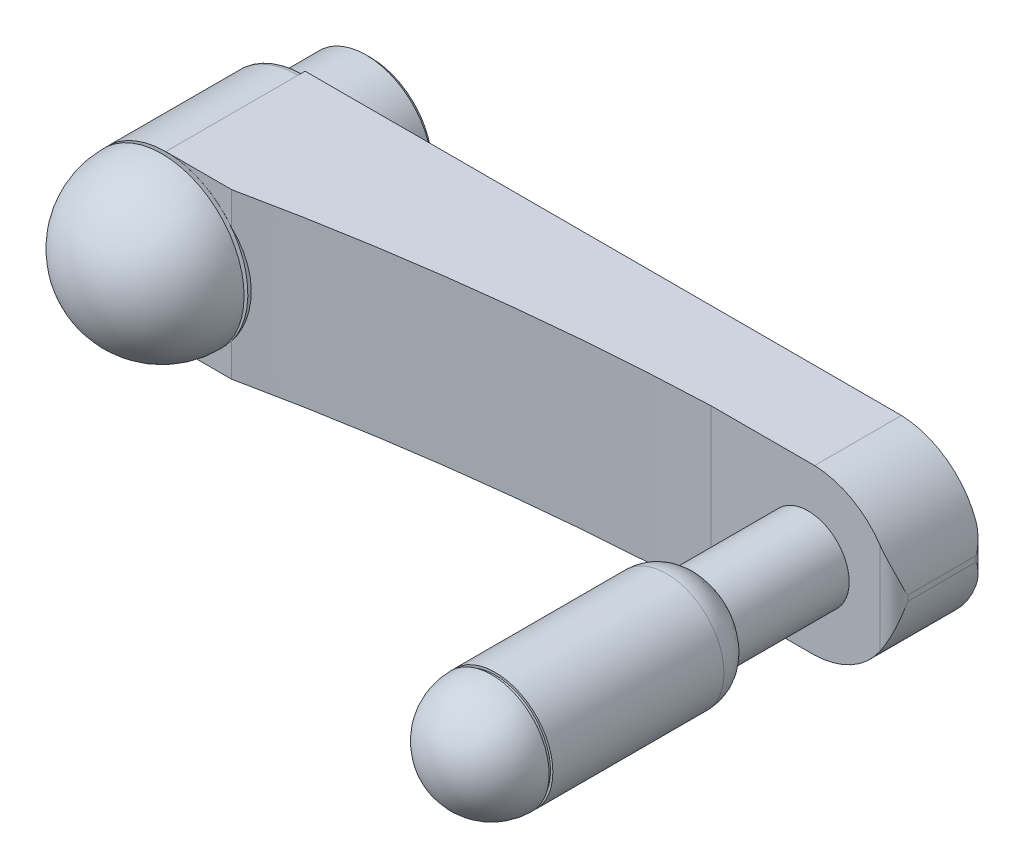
ISO-10303-21;
HEADER;
FILE_DESCRIPTION(('STEP AP214'),'2;1');
FILE_NAME('part.step','',(''),(''),'','','');
FILE_SCHEMA(('AUTOMOTIVE_DESIGN { 1 0 10303 214 1 1 1 1 }'));
ENDSEC;
DATA;
#1=APPLICATION_CONTEXT('core data for automotive mechanical design processes');
#2=APPLICATION_PROTOCOL_DEFINITION('international standard','automotive_design',2000,#1);
#3=PRODUCT_CONTEXT('',#1,'mechanical');
#4=PRODUCT('Part','Part','',(#3));
#5=PRODUCT_RELATED_PRODUCT_CATEGORY('part','',(#4));
#6=PRODUCT_DEFINITION_FORMATION('','',#4);
#7=PRODUCT_DEFINITION_CONTEXT('part definition',#1,'design');
#8=PRODUCT_DEFINITION('design','',#6,#7);
#9=PRODUCT_DEFINITION_SHAPE('','',#8);
#10=(LENGTH_UNIT() NAMED_UNIT(*) SI_UNIT(.MILLI.,.METRE.));
#11=(NAMED_UNIT(*) PLANE_ANGLE_UNIT() SI_UNIT($,.RADIAN.));
#12=(NAMED_UNIT(*) SI_UNIT($,.STERADIAN.) SOLID_ANGLE_UNIT());
#13=UNCERTAINTY_MEASURE_WITH_UNIT(LENGTH_MEASURE(1.E-05),#10,'distance_accuracy_value','');
#14=(GEOMETRIC_REPRESENTATION_CONTEXT(3) GLOBAL_UNCERTAINTY_ASSIGNED_CONTEXT((#13)) GLOBAL_UNIT_ASSIGNED_CONTEXT((#10,
#11,#12)) REPRESENTATION_CONTEXT('',''));
#15=CARTESIAN_POINT('',(0.,0.,0.));
#16=DIRECTION('',(0.,0.,1.));
#17=DIRECTION('',(1.,0.,0.));
#18=AXIS2_PLACEMENT_3D('',#15,#16,#17);
#19=CARTESIAN_POINT('',(126.,0.,14.));
#20=DIRECTION('',(0.,0.,-1.));
#21=DIRECTION('',(0.,1.,0.));
#22=AXIS2_PLACEMENT_3D('',#19,#20,#21);
#23=CYLINDRICAL_SURFACE('',#22,3.3235);
#24=CARTESIAN_POINT('',(126.,0.,14.6765));
#25=DIRECTION('',(0.,0.,-1.));
#26=DIRECTION('',(0.,1.,0.));
#27=AXIS2_PLACEMENT_3D('',#24,#25,#26);
#28=CIRCLE('',#27,3.3235);
#29=CARTESIAN_POINT('',(126.,3.3235,14.6765));
#30=VERTEX_POINT('',#29);
#31=EDGE_CURVE('E240',#30,#30,#28,.T.);
#32=ORIENTED_EDGE('',*,*,#31,.T.);
#33=EDGE_LOOP('',(#32));
#34=FACE_BOUND('',#33,.T.);
#35=CARTESIAN_POINT('',(126.,0.,17.5905));
#36=DIRECTION('',(0.,0.,1.));
#37=DIRECTION('',(0.,-1.,0.));
#38=AXIS2_PLACEMENT_3D('',#35,#36,#37);
#39=CIRCLE('',#38,3.3235);
#40=CARTESIAN_POINT('',(126.,-3.3235,17.5905));
#41=VERTEX_POINT('',#40);
#42=EDGE_CURVE('E9',#41,#41,#39,.F.);
#43=ORIENTED_EDGE('',*,*,#42,.F.);
#44=EDGE_LOOP('',(#43));
#45=FACE_BOUND('',#44,.T.);
#46=ADVANCED_FACE('F14',(#34,#45),#23,.F.);
#47=CARTESIAN_POINT('',(126.,0.,14.6765));
#48=DIRECTION('',(0.,0.,-1.));
#49=DIRECTION('',(0.,1.,0.));
#50=AXIS2_PLACEMENT_3D('',#47,#48,#49);
#51=CONICAL_SURFACE('',#50,3.3235,0.785398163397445);
#52=CARTESIAN_POINT('',(126.,0.,14.));
#53=DIRECTION('',(0.,0.,-1.));
#54=DIRECTION('',(0.,1.,0.));
#55=AXIS2_PLACEMENT_3D('',#52,#53,#54);
#56=CIRCLE('',#55,4.);
#57=CARTESIAN_POINT('',(126.,4.,14.));
#58=VERTEX_POINT('',#57);
#59=EDGE_CURVE('E237',#58,#58,#56,.T.);
#60=ORIENTED_EDGE('',*,*,#59,.T.);
#61=EDGE_LOOP('',(#60));
#62=FACE_BOUND('',#61,.T.);
#63=ORIENTED_EDGE('',*,*,#31,.F.);
#64=EDGE_LOOP('',(#63));
#65=FACE_BOUND('',#64,.T.);
#66=ADVANCED_FACE('F459',(#62,#65),#51,.F.);
#67=CARTESIAN_POINT('',(141.,-17.5,32.5));
#68=DIRECTION('',(0.,0.,-1.));
#69=DIRECTION('',(0.,1.,0.));
#70=AXIS2_PLACEMENT_3D('',#67,#68,#69);
#71=PLANE('',#70);
#72=DIRECTION('',(-1.,0.,0.));
#73=VECTOR('',#72,1.);
#74=CARTESIAN_POINT('',(141.,-17.5,32.5));
#75=LINE('',#74,#73);
#76=CARTESIAN_POINT('',(127.0916924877,-17.5,32.5));
#77=VERTEX_POINT('',#76);
#78=CARTESIAN_POINT('',(105.03304733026,-17.5,32.5));
#79=VERTEX_POINT('',#78);
#80=EDGE_CURVE('E405',#77,#79,#75,.T.);
#81=ORIENTED_EDGE('',*,*,#80,.F.);
#82=CARTESIAN_POINT('',(126.5,0.,32.5));
#83=DIRECTION('',(0.,0.,-1.));
#84=DIRECTION('',(0.,1.,0.));
#85=AXIS2_PLACEMENT_3D('',#82,#83,#84);
#86=CIRCLE('',#85,17.51);
#87=CARTESIAN_POINT('',(141.000000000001,-9.81580867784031,32.5));
#88=VERTEX_POINT('',#87);
#89=EDGE_CURVE('E373',#77,#88,#86,.F.);
#90=ORIENTED_EDGE('',*,*,#89,.T.);
#91=DIRECTION('',(0.,1.,0.));
#92=VECTOR('',#91,1.);
#93=CARTESIAN_POINT('',(141.000000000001,-17.5,32.5));
#94=LINE('',#93,#92);
#95=CARTESIAN_POINT('',(141.000000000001,9.81580867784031,32.5));
#96=VERTEX_POINT('',#95);
#97=EDGE_CURVE('E434',#88,#96,#94,.T.);
#98=ORIENTED_EDGE('',*,*,#97,.T.);
#99=CARTESIAN_POINT('',(127.0916924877,17.5,32.5));
#100=VERTEX_POINT('',#99);
#101=EDGE_CURVE('E909',#96,#100,#86,.F.);
#102=ORIENTED_EDGE('',*,*,#101,.T.);
#103=DIRECTION('',(-1.,0.,0.));
#104=VECTOR('',#103,1.);
#105=CARTESIAN_POINT('',(141.,17.5,32.5));
#106=LINE('',#105,#104);
#107=CARTESIAN_POINT('',(105.03304733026,17.5,32.5));
#108=VERTEX_POINT('',#107);
#109=EDGE_CURVE('E421',#100,#108,#106,.T.);
#110=ORIENTED_EDGE('',*,*,#109,.T.);
#111=DIRECTION('',(0.,1.,0.));
#112=VECTOR('',#111,1.);
#113=CARTESIAN_POINT('',(105.03304733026,-17.5,32.5));
#114=LINE('',#113,#112);
#115=EDGE_CURVE('E431',#79,#108,#114,.T.);
#116=ORIENTED_EDGE('',*,*,#115,.F.);
#117=EDGE_LOOP('',(#81,#90,#98,#102,#110,#116));
#118=FACE_BOUND('',#117,.T.);
#119=CARTESIAN_POINT('',(126.,0.,32.5));
#120=DIRECTION('',(0.,0.,1.));
#121=DIRECTION('',(1.,0.,0.));
#122=AXIS2_PLACEMENT_3D('',#119,#120,#121);
#123=CIRCLE('',#122,5.775);
#124=CARTESIAN_POINT('',(131.775,0.,32.5));
#125=VERTEX_POINT('',#124);
#126=EDGE_CURVE('E232',#125,#125,#123,.T.);
#127=ORIENTED_EDGE('',*,*,#126,.F.);
#128=EDGE_LOOP('',(#127));
#129=FACE_BOUND('',#128,.T.);
#130=ADVANCED_FACE('F379',(#118,#129),#71,.F.);
#131=CARTESIAN_POINT('',(143.000000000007,-17.5,14.9999999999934));
#132=DIRECTION('',(0.,-1.,0.));
#133=DIRECTION('',(1.,0.,0.));
#134=AXIS2_PLACEMENT_3D('',#131,#132,#133);
#135=PLANE('',#134);
#136=DIRECTION('',(0.,0.,-1.));
#137=VECTOR('',#136,1.);
#138=CARTESIAN_POINT('',(127.0916924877,-17.5,126.));
#139=LINE('',#138,#137);
#140=CARTESIAN_POINT('',(127.0916924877,-17.5,14.));
#141=VERTEX_POINT('',#140);
#142=EDGE_CURVE('E374',#77,#141,#139,.T.);
#143=ORIENTED_EDGE('',*,*,#142,.F.);
#144=ORIENTED_EDGE('',*,*,#80,.T.);
#145=CARTESIAN_POINT('',(124.516523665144,-17.5,566.88392551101));
#146=DIRECTION('',(0.,-1.,0.));
#147=DIRECTION('',(1.,0.,0.));
#148=AXIS2_PLACEMENT_3D('',#145,#146,#147);
#149=CIRCLE('',#148,534.738988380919);
#150=CARTESIAN_POINT('',(13.9999999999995,-17.5,43.69));
#151=VERTEX_POINT('',#150);
#152=EDGE_CURVE('E407',#151,#79,#149,.T.);
#153=ORIENTED_EDGE('',*,*,#152,.F.);
#154=DIRECTION('',(-1.,0.,0.));
#155=VECTOR('',#154,1.);
#156=CARTESIAN_POINT('',(14.,-17.5,43.69));
#157=LINE('',#156,#155);
#158=CARTESIAN_POINT('',(0.,-17.5,43.69));
#159=VERTEX_POINT('',#158);
#160=EDGE_CURVE('E410',#151,#159,#157,.T.);
#161=ORIENTED_EDGE('',*,*,#160,.T.);
#162=DIRECTION('',(0.,0.,-1.));
#163=VECTOR('',#162,1.);
#164=CARTESIAN_POINT('',(0.,-17.5,43.69));
#165=LINE('',#164,#163);
#166=CARTESIAN_POINT('',(0.,-17.5,15.5));
#167=VERTEX_POINT('',#166);
#168=EDGE_CURVE('E398',#159,#167,#165,.T.);
#169=ORIENTED_EDGE('',*,*,#168,.T.);
#170=CARTESIAN_POINT('',(0.,-17.5,14.));
#171=VERTEX_POINT('',#170);
#172=EDGE_CURVE('E402',#167,#171,#165,.T.);
#173=ORIENTED_EDGE('',*,*,#172,.T.);
#174=DIRECTION('',(1.,0.,0.));
#175=VECTOR('',#174,1.);
#176=CARTESIAN_POINT('',(0.,-17.5,14.));
#177=LINE('',#176,#175);
#178=EDGE_CURVE('E401',#171,#141,#177,.T.);
#179=ORIENTED_EDGE('',*,*,#178,.T.);
#180=EDGE_LOOP('',(#143,#144,#153,#161,#169,#173,#179));
#181=FACE_BOUND('',#180,.T.);
#182=ADVANCED_FACE('F338',(#181),#135,.T.);
#183=CARTESIAN_POINT('',(126.5,0.,126.));
#184=DIRECTION('',(0.,0.,-1.));
#185=DIRECTION('',(0.,1.,0.));
#186=AXIS2_PLACEMENT_3D('',#183,#184,#185);
#187=CYLINDRICAL_SURFACE('',#186,17.51);
#188=CARTESIAN_POINT('',(144.,-0.591692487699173,14.9999999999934));
#189=CARTESIAN_POINT('',(144.000000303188,-0.591683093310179,14.9976399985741));
#190=CARTESIAN_POINT('',(143.999991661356,-0.59193914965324,14.9952952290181));
#191=CARTESIAN_POINT('',(143.999959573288,-0.592887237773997,14.9907381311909));
#192=CARTESIAN_POINT('',(143.999936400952,-0.593571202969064,14.9885241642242));
#193=CARTESIAN_POINT('',(143.999869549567,-0.595539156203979,14.9836080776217));
#194=CARTESIAN_POINT('',(143.999821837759,-0.596940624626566,14.9809546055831));
#195=CARTESIAN_POINT('',(143.999712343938,-0.600142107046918,14.9758822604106));
#196=CARTESIAN_POINT('',(143.999650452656,-0.601945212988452,14.9734654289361));
#197=CARTESIAN_POINT('',(143.999420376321,-0.608611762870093,14.9654785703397));
#198=CARTESIAN_POINT('',(143.999228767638,-0.614104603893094,14.9604480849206));
#199=CARTESIAN_POINT('',(143.998817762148,-0.625709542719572,14.9511774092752));
#200=CARTESIAN_POINT('',(143.99859821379,-0.63182497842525,14.9469418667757));
#201=CARTESIAN_POINT('',(143.997435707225,-0.663692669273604,14.9264896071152));
#202=CARTESIAN_POINT('',(143.996358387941,-0.691597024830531,14.9137978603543));
#203=CARTESIAN_POINT('',(143.994036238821,-0.748084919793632,14.890424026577));
#204=CARTESIAN_POINT('',(143.992790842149,-0.77667047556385,14.8797490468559));
#205=CARTESIAN_POINT('',(143.988843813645,-0.862351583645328,14.8496153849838));
#206=CARTESIAN_POINT('',(143.985907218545,-0.920043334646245,14.8317523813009));
#207=CARTESIAN_POINT('',(143.979432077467,-1.03583191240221,14.7975167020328));
#208=CARTESIAN_POINT('',(143.975892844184,-1.09392912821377,14.7811457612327));
#209=CARTESIAN_POINT('',(143.968224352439,-1.21021353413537,14.749377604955));
#210=CARTESIAN_POINT('',(143.964096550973,-1.2684001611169,14.7339781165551));
#211=CARTESIAN_POINT('',(143.955248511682,-1.38485074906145,14.7037812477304));
#212=CARTESIAN_POINT('',(143.95052853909,-1.44311466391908,14.6889836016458));
#213=CARTESIAN_POINT('',(143.935432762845,-1.61851609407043,14.645136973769));
#214=CARTESIAN_POINT('',(143.924154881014,-1.73574968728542,14.6167709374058));
#215=CARTESIAN_POINT('',(143.899195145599,-1.97028497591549,14.5614050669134));
#216=CARTESIAN_POINT('',(143.885513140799,-2.0875866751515,14.5344053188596));
#217=CARTESIAN_POINT('',(143.84083526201,-2.43956673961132,14.4553237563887));
#218=CARTESIAN_POINT('',(143.806214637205,-2.6742371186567,14.4051800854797));
#219=CARTESIAN_POINT('',(143.727223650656,-3.14315405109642,14.3108545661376));
#220=CARTESIAN_POINT('',(143.682852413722,-3.37740056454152,14.2666732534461));
#221=CARTESIAN_POINT('',(143.584271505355,-3.84510719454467,14.1859428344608));
#222=CARTESIAN_POINT('',(143.530064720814,-4.07856752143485,14.1493914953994));
#223=CARTESIAN_POINT('',(143.437845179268,-4.44156885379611,14.1001709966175));
#224=CARTESIAN_POINT('',(143.403237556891,-4.5715201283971,14.0840795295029));
#225=CARTESIAN_POINT('',(143.330929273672,-4.83094700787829,14.0555444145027));
#226=CARTESIAN_POINT('',(143.293229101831,-4.96042268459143,14.0431001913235));
#227=CARTESIAN_POINT('',(143.214724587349,-5.21884249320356,14.0224792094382));
#228=CARTESIAN_POINT('',(143.173918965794,-5.34778638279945,14.0143042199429));
#229=CARTESIAN_POINT('',(143.089243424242,-5.60494970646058,14.0030849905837));
#230=CARTESIAN_POINT('',(143.045372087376,-5.73316877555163,14.0000431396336));
#231=CARTESIAN_POINT('',(143.,-5.86089583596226,14.));
#232=B_SPLINE_CURVE_WITH_KNOTS('',3,(#188,#189,#190,#191,#192,#193,#194,#195,#196,#197,#198,
#199,#200,#201,#202,#203,#204,#205,#206,#207,#208,#209,#210,#211,#212,#213,#214,#215,#216,#217,
#218,#219,#220,#221,#222,#223,#224,#225,#226,#227,#228,#229,#230,#231),.UNSPECIFIED.,.F.,.F.,(4,
2,2,2,2,2,2,2,2,2,2,2,2,2,2,2,2,2,2,2,2,4),(0.,0.00704184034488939,0.0139547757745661,
0.0229068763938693,0.0319304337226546,0.0541086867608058,0.0764128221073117,0.167802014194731,
0.259507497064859,0.440716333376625,0.622133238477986,0.803108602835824,0.984003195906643,
1.34738961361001,1.71079889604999,2.4378744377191,3.16501526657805,3.89194301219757,
4.29819192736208,4.70437672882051,5.1107297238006,5.51727177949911),.UNSPECIFIED.);
#233=CARTESIAN_POINT('',(144.,-0.591692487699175,14.9999999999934));
#234=VERTEX_POINT('',#233);
#235=CARTESIAN_POINT('',(143.,-5.86089583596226,14.));
#236=VERTEX_POINT('',#235);
#237=EDGE_CURVE('E390',#234,#236,#232,.T.);
#238=ORIENTED_EDGE('',*,*,#237,.F.);
#239=DIRECTION('',(0.,0.,-1.));
#240=VECTOR('',#239,1.);
#241=CARTESIAN_POINT('',(144.,-0.591692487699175,126.));
#242=LINE('',#241,#240);
#243=CARTESIAN_POINT('',(144.,-0.591692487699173,29.5));
#244=VERTEX_POINT('',#243);
#245=EDGE_CURVE('E372',#244,#234,#242,.T.);
#246=ORIENTED_EDGE('',*,*,#245,.F.);
#247=CARTESIAN_POINT('',(141.000000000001,-9.81580867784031,32.5));
#248=CARTESIAN_POINT('',(141.071388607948,-9.71035562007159,32.4999924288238));
#249=CARTESIAN_POINT('',(141.141608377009,-9.60414506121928,32.4974528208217));
#250=CARTESIAN_POINT('',(141.279605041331,-9.39039628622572,32.4877438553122));
#251=CARTESIAN_POINT('',(141.347382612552,-9.28285844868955,32.4805757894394));
#252=CARTESIAN_POINT('',(141.546722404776,-8.95882097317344,32.4528098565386));
#253=CARTESIAN_POINT('',(141.674539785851,-8.74053066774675,32.4259471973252));
#254=CARTESIAN_POINT('',(141.91921871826,-8.30125155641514,32.3585090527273));
#255=CARTESIAN_POINT('',(142.036123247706,-8.08027757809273,32.3179905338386));
#256=CARTESIAN_POINT('',(142.259539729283,-7.63537954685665,32.2254679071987));
#257=CARTESIAN_POINT('',(142.366045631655,-7.41145386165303,32.1734571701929));
#258=CARTESIAN_POINT('',(142.644914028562,-6.79183276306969,32.0170937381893));
#259=CARTESIAN_POINT('',(142.806487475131,-6.39374382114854,31.9028151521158));
#260=CARTESIAN_POINT('',(143.098259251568,-5.59283380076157,31.6527257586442));
#261=CARTESIAN_POINT('',(143.228439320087,-5.19001011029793,31.5169024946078));
#262=CARTESIAN_POINT('',(143.458406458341,-4.38061273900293,31.2292257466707));
#263=CARTESIAN_POINT('',(143.558141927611,-3.97403388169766,31.0773456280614));
#264=CARTESIAN_POINT('',(143.685238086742,-3.36317324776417,30.8407059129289));
#265=CARTESIAN_POINT('',(143.723846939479,-3.15942764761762,30.76037268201));
#266=CARTESIAN_POINT('',(143.793658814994,-2.75176482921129,30.5969839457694));
#267=CARTESIAN_POINT('',(143.824862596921,-2.54784763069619,30.5139287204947));
#268=CARTESIAN_POINT('',(143.866948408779,-2.23629725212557,30.3847668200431));
#269=CARTESIAN_POINT('',(143.880476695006,-2.12858327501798,30.3396961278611));
#270=CARTESIAN_POINT('',(143.905479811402,-1.91340014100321,30.2486071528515));
#271=CARTESIAN_POINT('',(143.916955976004,-1.8059308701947,30.202589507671));
#272=CARTESIAN_POINT('',(143.941077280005,-1.55844096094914,30.0949753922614));
#273=CARTESIAN_POINT('',(143.953001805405,-1.41854382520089,30.0329287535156));
#274=CARTESIAN_POINT('',(143.969808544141,-1.18915686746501,29.9266677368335));
#275=CARTESIAN_POINT('',(143.975695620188,-1.09913235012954,29.8837968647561));
#276=CARTESIAN_POINT('',(143.984187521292,-0.952190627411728,29.809050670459));
#277=CARTESIAN_POINT('',(143.987222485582,-0.894622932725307,29.7785206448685));
#278=CARTESIAN_POINT('',(143.991703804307,-0.801105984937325,29.724029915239));
#279=CARTESIAN_POINT('',(143.993339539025,-0.764457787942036,29.7013620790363));
#280=CARTESIAN_POINT('',(143.995521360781,-0.712133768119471,29.6643076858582));
#281=CARTESIAN_POINT('',(143.99619779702,-0.695291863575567,29.651591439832));
#282=CARTESIAN_POINT('',(143.997449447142,-0.663035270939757,29.6244387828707));
#283=CARTESIAN_POINT('',(143.998025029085,-0.647615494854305,29.6100089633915));
#284=CARTESIAN_POINT('',(143.998722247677,-0.628371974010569,29.587771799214));
#285=CARTESIAN_POINT('',(143.998908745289,-0.623150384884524,29.5811990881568));
#286=CARTESIAN_POINT('',(143.999249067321,-0.61351841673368,29.567471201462));
#287=CARTESIAN_POINT('',(143.999402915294,-0.609107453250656,29.5603164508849));
#288=CARTESIAN_POINT('',(143.99963780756,-0.602316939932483,29.5469823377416));
#289=CARTESIAN_POINT('',(143.999727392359,-0.599704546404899,29.5409237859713));
#290=CARTESIAN_POINT('',(143.999871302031,-0.595490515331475,29.5284700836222));
#291=CARTESIAN_POINT('',(143.999925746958,-0.593885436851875,29.5220761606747));
#292=CARTESIAN_POINT('',(143.999972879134,-0.592494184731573,29.5130167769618));
#293=CARTESIAN_POINT('',(143.999983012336,-0.592194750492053,29.5104251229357));
#294=CARTESIAN_POINT('',(143.99999658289,-0.591793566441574,29.5052227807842));
#295=CARTESIAN_POINT('',(144.000000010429,-0.591692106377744,29.5026120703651));
#296=CARTESIAN_POINT('',(144.,-0.591692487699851,29.5));
#297=B_SPLINE_CURVE_WITH_KNOTS('',3,(#247,#248,#249,#250,#251,#252,#253,#254,#255,#256,#257,
#258,#259,#260,#261,#262,#263,#264,#265,#266,#267,#268,#269,#270,#271,#272,#273,#274,#275,#276,
#277,#278,#279,#280,#281,#282,#283,#284,#285,#286,#287,#288,#289,#290,#291,#292,#293,#294,#295,
#296),.UNSPECIFIED.,.F.,.F.,(4,2,2,2,2,2,2,2,2,2,2,2,2,2,2,2,2,2,2,2,2,2,2,2,4),(0.,
0.381955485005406,0.763804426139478,1.52617807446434,2.28540999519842,3.04508102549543,
4.37669800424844,5.70908771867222,7.0437233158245,7.71077986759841,8.37776800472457,
8.73038363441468,9.0827691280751,9.54320930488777,9.84278211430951,10.0384237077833,
10.1675862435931,10.2308945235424,10.2939667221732,10.3191167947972,10.3442486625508,
10.3639796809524,10.3836429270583,10.3914631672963,10.3992948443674),.UNSPECIFIED.);
#298=EDGE_CURVE('E364',#88,#244,#297,.T.);
#299=ORIENTED_EDGE('',*,*,#298,.F.);
#300=ORIENTED_EDGE('',*,*,#89,.F.);
#301=ORIENTED_EDGE('',*,*,#142,.T.);
#302=CARTESIAN_POINT('',(126.5,0.,14.));
#303=DIRECTION('',(0.,0.,1.));
#304=DIRECTION('',(0.,-1.,0.));
#305=AXIS2_PLACEMENT_3D('',#302,#303,#304);
#306=CIRCLE('',#305,17.51);
#307=EDGE_CURVE('E397',#236,#141,#306,.F.);
#308=ORIENTED_EDGE('',*,*,#307,.F.);
#309=EDGE_LOOP('',(#238,#246,#299,#300,#301,#308));
#310=FACE_BOUND('',#309,.T.);
#311=ADVANCED_FACE('F333',(#310),#187,.T.);
#312=CARTESIAN_POINT('',(141.000000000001,-17.5,29.5000000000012));
#313=DIRECTION('',(0.,1.,0.));
#314=DIRECTION('',(-1.,0.,0.));
#315=AXIS2_PLACEMENT_3D('',#312,#313,#314);
#316=CYLINDRICAL_SURFACE('',#315,2.99999999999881);
#317=DIRECTION('',(0.,1.,0.));
#318=VECTOR('',#317,1.);
#319=CARTESIAN_POINT('',(144.,-17.5,29.5));
#320=LINE('',#319,#318);
#321=CARTESIAN_POINT('',(144.,0.591692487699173,29.5));
#322=VERTEX_POINT('',#321);
#323=EDGE_CURVE('E437',#244,#322,#320,.T.);
#324=ORIENTED_EDGE('',*,*,#323,.T.);
#325=CARTESIAN_POINT('',(144.,0.591692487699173,29.5));
#326=CARTESIAN_POINT('',(144.000001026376,0.591657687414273,29.507520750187));
#327=CARTESIAN_POINT('',(143.999971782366,0.592527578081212,29.514978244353));
#328=CARTESIAN_POINT('',(143.999863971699,0.595705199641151,29.5294180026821));
#329=CARTESIAN_POINT('',(143.999786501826,0.597980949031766,29.5364071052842));
#330=CARTESIAN_POINT('',(143.999560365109,0.604566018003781,29.5521530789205));
#331=CARTESIAN_POINT('',(143.999396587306,0.60929997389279,29.560724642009));
#332=CARTESIAN_POINT('',(143.999019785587,0.620029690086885,29.5771195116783));
#333=CARTESIAN_POINT('',(143.998806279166,0.626037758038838,29.5849343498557));
#334=CARTESIAN_POINT('',(143.997903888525,0.6509948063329,29.6142791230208));
#335=CARTESIAN_POINT('',(143.997088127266,0.672678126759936,29.633391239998));
#336=CARTESIAN_POINT('',(143.995287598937,0.71802001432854,29.6689876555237));
#337=CARTESIAN_POINT('',(143.994301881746,0.741689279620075,29.6854561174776));
#338=CARTESIAN_POINT('',(143.990813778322,0.821327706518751,29.737440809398));
#339=CARTESIAN_POINT('',(143.988005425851,0.879290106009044,29.7698910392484));
#340=CARTESIAN_POINT('',(143.981716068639,0.996604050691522,29.8321264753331));
#341=CARTESIAN_POINT('',(143.978233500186,1.05595853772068,29.8619052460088));
#342=CARTESIAN_POINT('',(143.97061458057,1.17527831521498,29.919891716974));
#343=CARTESIAN_POINT('',(143.966479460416,1.23524226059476,29.9481022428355));
#344=CARTESIAN_POINT('',(143.957561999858,1.3554580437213,30.0035977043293));
#345=CARTESIAN_POINT('',(143.952780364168,1.41570950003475,30.0308836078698));
#346=CARTESIAN_POINT('',(143.937488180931,1.59646210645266,30.1116980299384));
#347=CARTESIAN_POINT('',(143.926009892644,1.7172835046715,30.1643346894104));
#348=CARTESIAN_POINT('',(143.900466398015,1.95925687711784,30.2682064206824));
#349=CARTESIAN_POINT('',(143.886400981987,2.08040887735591,30.3194413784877));
#350=CARTESIAN_POINT('',(143.840293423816,2.44419466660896,30.4715938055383));
#351=CARTESIAN_POINT('',(143.804351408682,2.68702221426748,30.5708993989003));
#352=CARTESIAN_POINT('',(143.721877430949,3.17300531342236,30.7659349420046));
#353=CARTESIAN_POINT('',(143.675320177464,3.41616024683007,30.8616557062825));
#354=CARTESIAN_POINT('',(143.571541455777,3.90182228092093,31.048746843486));
#355=CARTESIAN_POINT('',(143.514321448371,4.14432946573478,31.1401178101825));
#356=CARTESIAN_POINT('',(143.348408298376,4.78552371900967,31.3753979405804));
#357=CARTESIAN_POINT('',(143.230405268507,5.18346168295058,31.5149331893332));
#358=CARTESIAN_POINT('',(142.964031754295,5.97582820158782,31.7753696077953));
#359=CARTESIAN_POINT('',(142.81563640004,6.37025360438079,31.8962553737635));
#360=CARTESIAN_POINT('',(142.570290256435,6.95632214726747,32.0580643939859));
#361=CARTESIAN_POINT('',(142.484977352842,7.15023276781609,32.1086367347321));
#362=CARTESIAN_POINT('',(142.306613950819,7.53632987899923,32.2023912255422));
#363=CARTESIAN_POINT('',(142.213562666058,7.72851619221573,32.2455726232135));
#364=CARTESIAN_POINT('',(142.019884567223,8.11042866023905,32.3232435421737));
#365=CARTESIAN_POINT('',(141.919270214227,8.30015828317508,32.3577469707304));
#366=CARTESIAN_POINT('',(141.710434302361,8.67693219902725,32.416684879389));
#367=CARTESIAN_POINT('',(141.602215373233,8.86397739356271,32.4411228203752));
#368=CARTESIAN_POINT('',(141.412138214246,9.17883975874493,32.4726117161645));
#369=CARTESIAN_POINT('',(141.332176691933,9.30750155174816,32.4826838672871));
#370=CARTESIAN_POINT('',(141.168701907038,9.56307241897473,32.4963729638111));
#371=CARTESIAN_POINT('',(141.085185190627,9.68997962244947,32.4999834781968));
#372=CARTESIAN_POINT('',(141.000000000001,9.81580867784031,32.5));
#373=B_SPLINE_CURVE_WITH_KNOTS('',3,(#325,#326,#327,#328,#329,#330,#331,#332,#333,#334,#335,
#336,#337,#338,#339,#340,#341,#342,#343,#344,#345,#346,#347,#348,#349,#350,#351,#352,#353,#354,
#355,#356,#357,#358,#359,#360,#361,#362,#363,#364,#365,#366,#367,#368,#369,#370,#371,#372),
.UNSPECIFIED.,.F.,.F.,(4,2,2,2,2,2,2,2,2,2,2,2,2,2,2,2,2,2,2,2,2,2,2,4),(0.,0.0224117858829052,
0.0443316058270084,0.073542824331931,0.103050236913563,0.189107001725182,0.275661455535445,
0.474723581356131,0.674253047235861,0.873410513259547,1.07235261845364,1.46916788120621,
1.86601531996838,2.66015649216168,3.45620985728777,4.25215424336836,5.56449373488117,
6.87791143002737,7.53109446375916,8.18434395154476,8.83653977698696,9.48851116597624,
9.94379399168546,10.3995296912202),.UNSPECIFIED.);
#374=EDGE_CURVE('E345',#322,#96,#373,.T.);
#375=ORIENTED_EDGE('',*,*,#374,.T.);
#376=ORIENTED_EDGE('',*,*,#97,.F.);
#377=ORIENTED_EDGE('',*,*,#298,.T.);
#378=EDGE_LOOP('',(#324,#375,#376,#377));
#379=FACE_BOUND('',#378,.T.);
#380=ADVANCED_FACE('F337',(#379),#316,.T.);
#381=DIRECTION('',(0.,0.,-1.));
#382=VECTOR('',#381,1.);
#383=CARTESIAN_POINT('',(127.0916924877,17.5,126.));
#384=LINE('',#383,#382);
#385=CARTESIAN_POINT('',(127.0916924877,17.5,14.));
#386=VERTEX_POINT('',#385);
#387=EDGE_CURVE('E448',#100,#386,#384,.T.);
#388=ORIENTED_EDGE('',*,*,#387,.F.);
#389=ORIENTED_EDGE('',*,*,#101,.F.);
#390=ORIENTED_EDGE('',*,*,#374,.F.);
#391=DIRECTION('',(0.,0.,-1.));
#392=VECTOR('',#391,1.);
#393=CARTESIAN_POINT('',(144.,0.591692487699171,126.));
#394=LINE('',#393,#392);
#395=CARTESIAN_POINT('',(144.,0.591692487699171,14.9999999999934));
#396=VERTEX_POINT('',#395);
#397=EDGE_CURVE('E913',#396,#322,#394,.F.);
#398=ORIENTED_EDGE('',*,*,#397,.F.);
#399=CARTESIAN_POINT('',(143.,5.86089583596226,14.));
#400=CARTESIAN_POINT('',(143.028131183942,5.78169993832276,14.0000063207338));
#401=CARTESIAN_POINT('',(143.055688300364,5.70231042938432,14.0011862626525));
#402=CARTESIAN_POINT('',(143.10963602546,5.54320700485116,14.0056584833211));
#403=CARTESIAN_POINT('',(143.136026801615,5.46349313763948,14.0089504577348));
#404=CARTESIAN_POINT('',(143.2134009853,5.22402699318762,14.0216373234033));
#405=CARTESIAN_POINT('',(143.262622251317,5.06384878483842,14.0338437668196));
#406=CARTESIAN_POINT('',(143.356199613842,4.74304758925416,14.0642993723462));
#407=CARTESIAN_POINT('',(143.400565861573,4.58242627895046,14.082535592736));
#408=CARTESIAN_POINT('',(143.484558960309,4.26057749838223,14.1239889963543));
#409=CARTESIAN_POINT('',(143.524185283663,4.09934996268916,14.1472067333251));
#410=CARTESIAN_POINT('',(143.604010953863,3.75349516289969,14.2013652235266));
#411=CARTESIAN_POINT('',(143.643490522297,3.56880058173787,14.2329347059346));
#412=CARTESIAN_POINT('',(143.716329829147,3.19900152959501,14.3004744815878));
#413=CARTESIAN_POINT('',(143.749688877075,3.01389701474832,14.3364452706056));
#414=CARTESIAN_POINT('',(143.821243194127,2.57677468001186,14.4256197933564));
#415=CARTESIAN_POINT('',(143.856860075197,2.3246441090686,14.4803673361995));
#416=CARTESIAN_POINT('',(143.907103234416,1.90314425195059,14.5768250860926));
#417=CARTESIAN_POINT('',(143.92478250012,1.73375878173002,14.6169203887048));
#418=CARTESIAN_POINT('',(143.95008449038,1.45171732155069,14.6865956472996));
#419=CARTESIAN_POINT('',(143.959095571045,1.33895457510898,14.7152307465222));
#420=CARTESIAN_POINT('',(143.972245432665,1.15167685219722,14.7651270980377));
#421=CARTESIAN_POINT('',(143.977005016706,1.07700843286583,14.785643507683));
#422=CARTESIAN_POINT('',(143.984105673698,0.953204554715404,14.8218029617));
#423=CARTESIAN_POINT('',(143.986722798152,0.903895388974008,14.8367760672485));
#424=CARTESIAN_POINT('',(143.990712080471,0.822289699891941,14.8635903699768));
#425=CARTESIAN_POINT('',(143.992208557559,0.789797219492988,14.8748135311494));
#426=CARTESIAN_POINT('',(143.994534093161,0.736097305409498,14.8952546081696));
#427=CARTESIAN_POINT('',(143.995420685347,0.714696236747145,14.9039163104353));
#428=CARTESIAN_POINT('',(143.996815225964,0.679530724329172,14.919995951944));
#429=CARTESIAN_POINT('',(143.997353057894,0.665529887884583,14.9269137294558));
#430=CARTESIAN_POINT('',(143.998348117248,0.638809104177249,14.9420270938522));
#431=CARTESIAN_POINT('',(143.998807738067,0.626060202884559,14.9501590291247));
#432=CARTESIAN_POINT('',(143.999287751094,0.612400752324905,14.9622109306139));
#433=CARTESIAN_POINT('',(143.999369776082,0.610051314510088,14.9644282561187));
#434=CARTESIAN_POINT('',(143.999525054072,0.605580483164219,14.9690927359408));
#435=CARTESIAN_POINT('',(143.999598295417,0.603459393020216,14.9715401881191));
#436=CARTESIAN_POINT('',(143.99972211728,0.59985715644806,14.9763249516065));
#437=CARTESIAN_POINT('',(143.999774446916,0.598327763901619,14.9786252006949));
#438=CARTESIAN_POINT('',(143.999865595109,0.595655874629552,14.9834313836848));
#439=CARTESIAN_POINT('',(143.999904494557,0.594511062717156,14.9859359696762));
#440=CARTESIAN_POINT('',(143.999955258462,0.593014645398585,14.9903663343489));
#441=CARTESIAN_POINT('',(143.999971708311,0.592528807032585,14.992245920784));
#442=CARTESIAN_POINT('',(143.999994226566,0.591863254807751,14.9960809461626));
#443=CARTESIAN_POINT('',(144.000000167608,0.591687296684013,14.9980370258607));
#444=CARTESIAN_POINT('',(144.,0.591692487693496,14.9999999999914));
#445=B_SPLINE_CURVE_WITH_KNOTS('',3,(#399,#400,#401,#402,#403,#404,#405,#406,#407,#408,#409,
#410,#411,#412,#413,#414,#415,#416,#417,#418,#419,#420,#421,#422,#423,#424,#425,#426,#427,#428,
#429,#430,#431,#432,#433,#434,#435,#436,#437,#438,#439,#440,#441,#442,#443,#444),.UNSPECIFIED.,
.F.,.F.,(4,2,2,2,2,2,2,2,2,2,2,2,2,2,2,2,2,2,2,2,2,2,4),(0.,0.252105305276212,0.504174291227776,
1.00798993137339,1.51073117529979,2.01352833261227,2.58782253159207,3.16218147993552,
3.94319268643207,4.4679915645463,4.81802142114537,5.05074662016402,5.20550724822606,
5.30871881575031,5.37795204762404,5.42485112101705,5.46983667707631,5.47951943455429,
5.48921490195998,5.49747932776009,5.50569307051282,5.51149312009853,5.5173629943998),.UNSPECIFIED.);
#446=CARTESIAN_POINT('',(143.,5.86089583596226,14.));
#447=VERTEX_POINT('',#446);
#448=EDGE_CURVE('E356',#447,#396,#445,.T.);
#449=ORIENTED_EDGE('',*,*,#448,.F.);
#450=EDGE_CURVE('E908',#386,#447,#306,.F.);
#451=ORIENTED_EDGE('',*,*,#450,.F.);
#452=EDGE_LOOP('',(#388,#389,#390,#398,#449,#451));
#453=FACE_BOUND('',#452,.T.);
#454=ADVANCED_FACE('F340',(#453),#187,.T.);
#455=CARTESIAN_POINT('',(143.000000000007,17.5,14.9999999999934));
#456=DIRECTION('',(0.,-1.,0.));
#457=DIRECTION('',(1.,0.,0.));
#458=AXIS2_PLACEMENT_3D('',#455,#456,#457);
#459=PLANE('',#458);
#460=ORIENTED_EDGE('',*,*,#109,.F.);
#461=ORIENTED_EDGE('',*,*,#387,.T.);
#462=DIRECTION('',(1.,0.,0.));
#463=VECTOR('',#462,1.);
#464=CARTESIAN_POINT('',(0.,17.5,14.));
#465=LINE('',#464,#463);
#466=CARTESIAN_POINT('',(0.,17.5,14.));
#467=VERTEX_POINT('',#466);
#468=EDGE_CURVE('E417',#467,#386,#465,.T.);
#469=ORIENTED_EDGE('',*,*,#468,.F.);
#470=DIRECTION('',(0.,0.,-1.));
#471=VECTOR('',#470,1.);
#472=CARTESIAN_POINT('',(0.,17.5,43.69));
#473=LINE('',#472,#471);
#474=CARTESIAN_POINT('',(0.,17.5,15.5));
#475=VERTEX_POINT('',#474);
#476=EDGE_CURVE('E418',#475,#467,#473,.T.);
#477=ORIENTED_EDGE('',*,*,#476,.F.);
#478=CARTESIAN_POINT('',(0.,17.5,43.69));
#479=VERTEX_POINT('',#478);
#480=EDGE_CURVE('E414',#479,#475,#473,.T.);
#481=ORIENTED_EDGE('',*,*,#480,.F.);
#482=DIRECTION('',(-1.,0.,0.));
#483=VECTOR('',#482,1.);
#484=CARTESIAN_POINT('',(14.,17.5,43.69));
#485=LINE('',#484,#483);
#486=CARTESIAN_POINT('',(13.9999999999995,17.5,43.69));
#487=VERTEX_POINT('',#486);
#488=EDGE_CURVE('E426',#487,#479,#485,.T.);
#489=ORIENTED_EDGE('',*,*,#488,.F.);
#490=CARTESIAN_POINT('',(124.516523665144,17.5,566.88392551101));
#491=DIRECTION('',(0.,-1.,0.));
#492=DIRECTION('',(1.,0.,0.));
#493=AXIS2_PLACEMENT_3D('',#490,#491,#492);
#494=CIRCLE('',#493,534.738988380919);
#495=EDGE_CURVE('E423',#487,#108,#494,.T.);
#496=ORIENTED_EDGE('',*,*,#495,.T.);
#497=EDGE_LOOP('',(#460,#461,#469,#477,#481,#489,#496));
#498=FACE_BOUND('',#497,.T.);
#499=ADVANCED_FACE('F806',(#498),#459,.F.);
#500=CARTESIAN_POINT('',(124.516523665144,-17.5,566.88392551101));
#501=DIRECTION('',(0.,1.,0.));
#502=DIRECTION('',(-1.,0.,0.));
#503=AXIS2_PLACEMENT_3D('',#500,#501,#502);
#504=CYLINDRICAL_SURFACE('',#503,534.738988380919);
#505=DIRECTION('',(0.,1.,0.));
#506=VECTOR('',#505,1.);
#507=CARTESIAN_POINT('',(13.9999999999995,-17.5,43.69));
#508=LINE('',#507,#506);
#509=CARTESIAN_POINT('',(13.9999999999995,10.5000000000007,43.69));
#510=VERTEX_POINT('',#509);
#511=EDGE_CURVE('E413',#510,#487,#508,.T.);
#512=ORIENTED_EDGE('',*,*,#511,.F.);
#513=CARTESIAN_POINT('',(13.9999999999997,10.5000000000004,43.69));
#514=CARTESIAN_POINT('',(14.1447169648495,10.3070447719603,43.6594308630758));
#515=CARTESIAN_POINT('',(14.2854960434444,10.1110268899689,43.6297561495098));
#516=CARTESIAN_POINT('',(14.5589423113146,9.71315975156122,43.5722253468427));
#517=CARTESIAN_POINT('',(14.6916096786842,9.51131062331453,43.5443692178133));
#518=CARTESIAN_POINT('',(15.0770526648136,8.89751864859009,43.4635811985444));
#519=CARTESIAN_POINT('',(15.317321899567,8.47726091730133,43.4134185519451));
#520=CARTESIAN_POINT('',(15.7624798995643,7.61764262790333,43.3207531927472));
#521=CARTESIAN_POINT('',(15.967371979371,7.178283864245,43.2782497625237));
#522=CARTESIAN_POINT('',(16.2469510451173,6.50732917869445,43.2203938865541));
#523=CARTESIAN_POINT('',(16.3355197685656,6.28168467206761,43.2020913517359));
#524=CARTESIAN_POINT('',(16.5032768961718,5.82671875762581,43.1674644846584));
#525=CARTESIAN_POINT('',(16.5824628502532,5.59739640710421,43.151140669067));
#526=CARTESIAN_POINT('',(16.8057507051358,4.90432205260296,43.1051570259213));
#527=CARTESIAN_POINT('',(16.935500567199,4.43565958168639,43.0785019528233));
#528=CARTESIAN_POINT('',(17.1556000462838,3.48878733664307,43.0333452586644));
#529=CARTESIAN_POINT('',(17.2459498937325,3.01057761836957,43.0148435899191));
#530=CARTESIAN_POINT('',(17.3513726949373,2.28888627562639,42.9932715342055));
#531=CARTESIAN_POINT('',(17.3814954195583,2.04761263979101,42.9871111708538));
#532=CARTESIAN_POINT('',(17.4316624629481,1.56404047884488,42.9768546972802));
#533=CARTESIAN_POINT('',(17.4517093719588,1.32174223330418,42.9727580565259));
#534=CARTESIAN_POINT('',(17.4966743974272,0.593835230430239,42.9635702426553));
#535=CARTESIAN_POINT('',(17.5064249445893,0.107158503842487,42.9615795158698));
#536=CARTESIAN_POINT('',(17.4854418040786,-0.861660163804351,42.9658658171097));
#537=CARTESIAN_POINT('',(17.455003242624,-1.34380926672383,42.9720825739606));
#538=CARTESIAN_POINT('',(17.3544057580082,-2.3037988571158,42.992649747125));
#539=CARTESIAN_POINT('',(17.2842460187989,-2.78163925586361,43.0070003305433));
#540=CARTESIAN_POINT('',(17.1047314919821,-3.72975274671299,43.0437772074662));
#541=CARTESIAN_POINT('',(16.9953625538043,-4.20002304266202,43.0662064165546));
#542=CARTESIAN_POINT('',(16.7383048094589,-5.1294831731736,43.119036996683));
#543=CARTESIAN_POINT('',(16.5906193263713,-5.58867396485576,43.1494376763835));
#544=CARTESIAN_POINT('',(16.2774066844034,-6.44029017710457,43.2140851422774));
#545=CARTESIAN_POINT('',(16.1159380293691,-6.83428027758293,43.2474763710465));
#546=CARTESIAN_POINT('',(15.7649712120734,-7.6089751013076,43.320254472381));
#547=CARTESIAN_POINT('',(15.5754751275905,-7.98968080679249,43.3596409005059));
#548=CARTESIAN_POINT('',(15.1697581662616,-8.73546881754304,43.444231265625));
#549=CARTESIAN_POINT('',(14.953560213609,-9.10056416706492,43.4894302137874));
#550=CARTESIAN_POINT('',(14.4956131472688,-9.81361539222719,43.585502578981));
#551=CARTESIAN_POINT('',(14.2538623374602,-10.1615701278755,43.6363763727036));
#552=CARTESIAN_POINT('',(13.9999999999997,-10.5000000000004,43.69));
#553=B_SPLINE_CURVE_WITH_KNOTS('',3,(#513,#514,#515,#516,#517,#518,#519,#520,#521,#522,#523,
#524,#525,#526,#527,#528,#529,#530,#531,#532,#533,#534,#535,#536,#537,#538,#539,#540,#541,#542,
#543,#544,#545,#546,#547,#548,#549,#550,#551,#552),.UNSPECIFIED.,.F.,.F.,(4,2,2,2,2,2,2,2,2,2,2,
2,2,2,2,2,2,2,2,4),(0.,0.729266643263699,1.45851726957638,2.91675364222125,4.37485331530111,
5.10394631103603,5.83322927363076,7.29243485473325,8.75163190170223,9.48111294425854,
10.2104063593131,11.6688247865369,13.1165927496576,14.5643904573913,16.0127112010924,
17.4609063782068,18.7410660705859,20.0211309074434,21.3001043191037,22.5791626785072),.UNSPECIFIED.);
#554=CARTESIAN_POINT('',(13.9999999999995,-10.5000000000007,43.69));
#555=VERTEX_POINT('',#554);
#556=EDGE_CURVE('E288',#510,#555,#553,.T.);
#557=ORIENTED_EDGE('',*,*,#556,.T.);
#558=EDGE_CURVE('E428',#151,#555,#508,.T.);
#559=ORIENTED_EDGE('',*,*,#558,.F.);
#560=ORIENTED_EDGE('',*,*,#152,.T.);
#561=ORIENTED_EDGE('',*,*,#115,.T.);
#562=ORIENTED_EDGE('',*,*,#495,.F.);
#563=EDGE_LOOP('',(#512,#557,#559,#560,#561,#562));
#564=FACE_BOUND('',#563,.T.);
#565=ADVANCED_FACE('F299',(#564),#504,.F.);
#566=CARTESIAN_POINT('',(14.,-17.5,43.69));
#567=DIRECTION('',(0.,0.,-1.));
#568=DIRECTION('',(0.,1.,0.));
#569=AXIS2_PLACEMENT_3D('',#566,#567,#568);
#570=PLANE('',#569);
#571=CARTESIAN_POINT('',(0.,0.,43.69));
#572=DIRECTION('',(0.,0.,-1.));
#573=DIRECTION('',(0.,1.,0.));
#574=AXIS2_PLACEMENT_3D('',#571,#572,#573);
#575=CIRCLE('',#574,17.5);
#576=EDGE_CURVE('E289',#159,#555,#575,.F.);
#577=ORIENTED_EDGE('',*,*,#576,.F.);
#578=ORIENTED_EDGE('',*,*,#160,.F.);
#579=ORIENTED_EDGE('',*,*,#558,.T.);
#580=EDGE_LOOP('',(#577,#578,#579));
#581=FACE_BOUND('',#580,.T.);
#582=ADVANCED_FACE('F309',(#581),#570,.F.);
#583=CARTESIAN_POINT('',(0.,0.,0.));
#584=DIRECTION('',(0.,0.,-1.));
#585=DIRECTION('',(0.,1.,0.));
#586=AXIS2_PLACEMENT_3D('',#583,#584,#585);
#587=CYLINDRICAL_SURFACE('',#586,17.5);
#588=ORIENTED_EDGE('',*,*,#576,.T.);
#589=ORIENTED_EDGE('',*,*,#556,.F.);
#590=EDGE_CURVE('E285',#510,#479,#575,.F.);
#591=ORIENTED_EDGE('',*,*,#590,.T.);
#592=ORIENTED_EDGE('',*,*,#480,.T.);
#593=CARTESIAN_POINT('',(0.,0.,15.5));
#594=DIRECTION('',(0.,0.,-1.));
#595=DIRECTION('',(0.,1.,0.));
#596=AXIS2_PLACEMENT_3D('',#593,#594,#595);
#597=CIRCLE('',#596,17.5);
#598=EDGE_CURVE('E270',#167,#475,#597,.T.);
#599=ORIENTED_EDGE('',*,*,#598,.F.);
#600=ORIENTED_EDGE('',*,*,#168,.F.);
#601=EDGE_LOOP('',(#588,#589,#591,#592,#599,#600));
#602=FACE_BOUND('',#601,.T.);
#603=CARTESIAN_POINT('',(0.,0.,43.7));
#604=DIRECTION('',(0.,0.,-1.));
#605=DIRECTION('',(0.,1.,0.));
#606=AXIS2_PLACEMENT_3D('',#603,#604,#605);
#607=CIRCLE('',#606,17.5);
#608=CARTESIAN_POINT('',(0.,17.5,43.7));
#609=VERTEX_POINT('',#608);
#610=EDGE_CURVE('E273',#609,#609,#607,.T.);
#611=ORIENTED_EDGE('',*,*,#610,.T.);
#612=EDGE_LOOP('',(#611));
#613=FACE_BOUND('',#612,.T.);
#614=ADVANCED_FACE('F303',(#602,#613),#587,.T.);
#615=CARTESIAN_POINT('',(0.,-17.5,43.69));
#616=DIRECTION('',(1.,0.,0.));
#617=DIRECTION('',(0.,1.,0.));
#618=AXIS2_PLACEMENT_3D('',#615,#616,#617);
#619=PLANE('',#618);
#620=ORIENTED_EDGE('',*,*,#172,.F.);
#621=CARTESIAN_POINT('',(0.,-16.0000000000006,15.4999999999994));
#622=DIRECTION('',(1.,0.,0.));
#623=DIRECTION('',(0.,1.,0.));
#624=AXIS2_PLACEMENT_3D('',#621,#622,#623);
#625=CIRCLE('',#624,1.49999999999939);
#626=CARTESIAN_POINT('',(0.,-16.0000000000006,14.));
#627=VERTEX_POINT('',#626);
#628=EDGE_CURVE('E116',#167,#627,#625,.T.);
#629=ORIENTED_EDGE('',*,*,#628,.T.);
#630=DIRECTION('',(0.,1.,0.));
#631=VECTOR('',#630,1.);
#632=CARTESIAN_POINT('',(0.,-17.5,14.));
#633=LINE('',#632,#631);
#634=EDGE_CURVE('E446',#171,#627,#633,.T.);
#635=ORIENTED_EDGE('',*,*,#634,.F.);
#636=EDGE_LOOP('',(#620,#629,#635));
#637=FACE_BOUND('',#636,.T.);
#638=ADVANCED_FACE('F308',(#637),#619,.F.);
#639=CARTESIAN_POINT('',(0.,-17.5,14.));
#640=DIRECTION('',(0.,0.,1.));
#641=DIRECTION('',(0.,-1.,0.));
#642=AXIS2_PLACEMENT_3D('',#639,#640,#641);
#643=PLANE('',#642);
#644=CARTESIAN_POINT('',(0.,0.,14.));
#645=DIRECTION('',(0.,0.,-1.));
#646=DIRECTION('',(0.,1.,0.));
#647=AXIS2_PLACEMENT_3D('',#644,#645,#646);
#648=CIRCLE('',#647,16.0000000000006);
#649=CARTESIAN_POINT('',(0.,16.0000000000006,14.));
#650=VERTEX_POINT('',#649);
#651=EDGE_CURVE('E267',#627,#650,#648,.T.);
#652=ORIENTED_EDGE('',*,*,#651,.T.);
#653=EDGE_CURVE('E123',#650,#467,#633,.T.);
#654=ORIENTED_EDGE('',*,*,#653,.T.);
#655=ORIENTED_EDGE('',*,*,#468,.T.);
#656=ORIENTED_EDGE('',*,*,#450,.T.);
#657=DIRECTION('',(0.,1.,0.));
#658=VECTOR('',#657,1.);
#659=CARTESIAN_POINT('',(143.,-17.5,14.));
#660=LINE('',#659,#658);
#661=EDGE_CURVE('E443',#236,#447,#660,.T.);
#662=ORIENTED_EDGE('',*,*,#661,.F.);
#663=ORIENTED_EDGE('',*,*,#307,.T.);
#664=ORIENTED_EDGE('',*,*,#178,.F.);
#665=ORIENTED_EDGE('',*,*,#634,.T.);
#666=EDGE_LOOP('',(#652,#654,#655,#656,#662,#663,#664,#665));
#667=FACE_BOUND('',#666,.T.);
#668=CARTESIAN_POINT('',(0.,0.,14.));
#669=DIRECTION('',(0.,0.,1.));
#670=DIRECTION('',(0.,-1.,0.));
#671=AXIS2_PLACEMENT_3D('',#668,#669,#670);
#672=CIRCLE('',#671,14.);
#673=CARTESIAN_POINT('',(0.,-14.,14.));
#674=VERTEX_POINT('',#673);
#675=EDGE_CURVE('E190',#674,#674,#672,.F.);
#676=ORIENTED_EDGE('',*,*,#675,.F.);
#677=EDGE_LOOP('',(#676));
#678=FACE_BOUND('',#677,.T.);
#679=ORIENTED_EDGE('',*,*,#59,.F.);
#680=EDGE_LOOP('',(#679));
#681=FACE_BOUND('',#680,.T.);
#682=ADVANCED_FACE('F387',(#667,#678,#681),#643,.F.);
#683=CARTESIAN_POINT('',(143.000000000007,-17.5,14.9999999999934));
#684=DIRECTION('',(0.,1.,0.));
#685=DIRECTION('',(-1.,0.,0.));
#686=AXIS2_PLACEMENT_3D('',#683,#684,#685);
#687=CYLINDRICAL_SURFACE('',#686,0.999999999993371);
#688=ORIENTED_EDGE('',*,*,#661,.T.);
#689=ORIENTED_EDGE('',*,*,#448,.T.);
#690=DIRECTION('',(0.,1.,0.));
#691=VECTOR('',#690,1.);
#692=CARTESIAN_POINT('',(144.,-17.5,14.9999999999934));
#693=LINE('',#692,#691);
#694=EDGE_CURVE('E440',#234,#396,#693,.T.);
#695=ORIENTED_EDGE('',*,*,#694,.F.);
#696=ORIENTED_EDGE('',*,*,#237,.T.);
#697=EDGE_LOOP('',(#688,#689,#695,#696));
#698=FACE_BOUND('',#697,.T.);
#699=ADVANCED_FACE('F383',(#698),#687,.T.);
#700=CARTESIAN_POINT('',(144.,-17.5,15.));
#701=DIRECTION('',(-1.,0.,0.));
#702=DIRECTION('',(0.,-1.,0.));
#703=AXIS2_PLACEMENT_3D('',#700,#701,#702);
#704=PLANE('',#703);
#705=ORIENTED_EDGE('',*,*,#694,.T.);
#706=ORIENTED_EDGE('',*,*,#397,.T.);
#707=ORIENTED_EDGE('',*,*,#323,.F.);
#708=ORIENTED_EDGE('',*,*,#245,.T.);
#709=EDGE_LOOP('',(#705,#706,#707,#708));
#710=FACE_BOUND('',#709,.T.);
#711=ADVANCED_FACE('F380',(#710),#704,.F.);
#712=ORIENTED_EDGE('',*,*,#653,.F.);
#713=CARTESIAN_POINT('',(0.,16.0000000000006,15.4999999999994));
#714=DIRECTION('',(1.,0.,0.));
#715=DIRECTION('',(0.,1.,0.));
#716=AXIS2_PLACEMENT_3D('',#713,#714,#715);
#717=CIRCLE('',#716,1.49999999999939);
#718=EDGE_CURVE('E297',#650,#475,#717,.T.);
#719=ORIENTED_EDGE('',*,*,#718,.T.);
#720=ORIENTED_EDGE('',*,*,#476,.T.);
#721=EDGE_LOOP('',(#712,#719,#720));
#722=FACE_BOUND('',#721,.T.);
#723=ADVANCED_FACE('F16',(#722),#619,.F.);
#724=ORIENTED_EDGE('',*,*,#590,.F.);
#725=ORIENTED_EDGE('',*,*,#511,.T.);
#726=ORIENTED_EDGE('',*,*,#488,.T.);
#727=EDGE_LOOP('',(#724,#725,#726));
#728=FACE_BOUND('',#727,.T.);
#729=ADVANCED_FACE('F769',(#728),#570,.F.);
#730=CARTESIAN_POINT('',(0.,0.,15.4999999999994));
#731=DIRECTION('',(0.,0.,-1.));
#732=DIRECTION('',(0.,1.,0.));
#733=AXIS2_PLACEMENT_3D('',#730,#731,#732);
#734=TOROIDAL_SURFACE('',#733,16.0000000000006,1.49999999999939);
#735=ORIENTED_EDGE('',*,*,#628,.F.);
#736=ORIENTED_EDGE('',*,*,#598,.T.);
#737=ORIENTED_EDGE('',*,*,#718,.F.);
#738=ORIENTED_EDGE('',*,*,#651,.F.);
#739=EDGE_LOOP('',(#735,#736,#737,#738));
#740=FACE_BOUND('',#739,.T.);
#741=ADVANCED_FACE('F311',(#740),#734,.T.);
#742=CARTESIAN_POINT('',(16.,0.,43.7));
#743=DIRECTION('',(0.,0.,-1.));
#744=DIRECTION('',(0.,1.,0.));
#745=AXIS2_PLACEMENT_3D('',#742,#743,#744);
#746=PLANE('',#745);
#747=ORIENTED_EDGE('',*,*,#610,.F.);
#748=EDGE_LOOP('',(#747));
#749=FACE_BOUND('',#748,.T.);
#750=CARTESIAN_POINT('',(0.,0.,43.7));
#751=DIRECTION('',(0.,0.,-1.));
#752=DIRECTION('',(0.,1.,0.));
#753=AXIS2_PLACEMENT_3D('',#750,#751,#752);
#754=CIRCLE('',#753,16.);
#755=CARTESIAN_POINT('',(0.,16.,43.7));
#756=VERTEX_POINT('',#755);
#757=EDGE_CURVE('E276',#756,#756,#754,.T.);
#758=ORIENTED_EDGE('',*,*,#757,.T.);
#759=EDGE_LOOP('',(#758));
#760=FACE_BOUND('',#759,.T.);
#761=ADVANCED_FACE('F313',(#749,#760),#746,.F.);
#762=CARTESIAN_POINT('',(0.,0.,0.));
#763=DIRECTION('',(0.,0.,-1.));
#764=DIRECTION('',(0.,1.,0.));
#765=AXIS2_PLACEMENT_3D('',#762,#763,#764);
#766=CYLINDRICAL_SURFACE('',#765,14.);
#767=CARTESIAN_POINT('',(0.,0.,1.));
#768=DIRECTION('',(0.,0.,-1.));
#769=DIRECTION('',(0.,1.,0.));
#770=AXIS2_PLACEMENT_3D('',#767,#768,#769);
#771=CIRCLE('',#770,14.);
#772=CARTESIAN_POINT('',(0.,14.,1.));
#773=VERTEX_POINT('',#772);
#774=EDGE_CURVE('E264',#773,#773,#771,.T.);
#775=ORIENTED_EDGE('',*,*,#774,.F.);
#776=EDGE_LOOP('',(#775));
#777=FACE_BOUND('',#776,.T.);
#778=ORIENTED_EDGE('',*,*,#675,.T.);
#779=EDGE_LOOP('',(#778));
#780=FACE_BOUND('',#779,.T.);
#781=ADVANCED_FACE('F316',(#777,#780),#766,.T.);
#782=CARTESIAN_POINT('',(0.,0.,0.));
#783=DIRECTION('',(0.,0.,-1.));
#784=DIRECTION('',(0.,1.,0.));
#785=AXIS2_PLACEMENT_3D('',#782,#783,#784);
#786=CYLINDRICAL_SURFACE('',#785,16.);
#787=ORIENTED_EDGE('',*,*,#757,.F.);
#788=EDGE_LOOP('',(#787));
#789=FACE_BOUND('',#788,.T.);
#790=CARTESIAN_POINT('',(0.,0.,44.5));
#791=DIRECTION('',(0.,0.,-1.));
#792=DIRECTION('',(0.,1.,0.));
#793=AXIS2_PLACEMENT_3D('',#790,#791,#792);
#794=CIRCLE('',#793,16.);
#795=CARTESIAN_POINT('',(0.,16.,44.5));
#796=VERTEX_POINT('',#795);
#797=EDGE_CURVE('E279',#796,#796,#794,.T.);
#798=ORIENTED_EDGE('',*,*,#797,.T.);
#799=EDGE_LOOP('',(#798));
#800=FACE_BOUND('',#799,.T.);
#801=ADVANCED_FACE('F318',(#789,#800),#786,.T.);
#802=CARTESIAN_POINT('',(0.,0.,1.));
#803=DIRECTION('',(0.,0.,1.));
#804=DIRECTION('',(0.,-1.,0.));
#805=AXIS2_PLACEMENT_3D('',#802,#803,#804);
#806=CONICAL_SURFACE('',#805,14.,0.785398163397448);
#807=CARTESIAN_POINT('',(0.,0.,0.));
#808=DIRECTION('',(0.,0.,-1.));
#809=DIRECTION('',(0.,1.,0.));
#810=AXIS2_PLACEMENT_3D('',#807,#808,#809);
#811=CIRCLE('',#810,13.);
#812=CARTESIAN_POINT('',(0.,13.,0.));
#813=VERTEX_POINT('',#812);
#814=EDGE_CURVE('E261',#813,#813,#811,.T.);
#815=ORIENTED_EDGE('',*,*,#814,.F.);
#816=EDGE_LOOP('',(#815));
#817=FACE_BOUND('',#816,.T.);
#818=ORIENTED_EDGE('',*,*,#774,.T.);
#819=EDGE_LOOP('',(#818));
#820=FACE_BOUND('',#819,.T.);
#821=ADVANCED_FACE('F321',(#817,#820),#806,.T.);
#822=CARTESIAN_POINT('',(17.5,0.,44.5000000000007));
#823=DIRECTION('',(0.,0.,1.));
#824=DIRECTION('',(0.,-1.,0.));
#825=AXIS2_PLACEMENT_3D('',#822,#823,#824);
#826=PLANE('',#825);
#827=ORIENTED_EDGE('',*,*,#797,.F.);
#828=EDGE_LOOP('',(#827));
#829=FACE_BOUND('',#828,.T.);
#830=CARTESIAN_POINT('',(0.,0.,44.5000000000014));
#831=DIRECTION('',(0.,0.,-1.));
#832=DIRECTION('',(0.,1.,0.));
#833=AXIS2_PLACEMENT_3D('',#830,#831,#832);
#834=CIRCLE('',#833,17.5);
#835=CARTESIAN_POINT('',(0.,17.5,44.5000000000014));
#836=VERTEX_POINT('',#835);
#837=EDGE_CURVE('E282',#836,#836,#834,.T.);
#838=ORIENTED_EDGE('',*,*,#837,.T.);
#839=EDGE_LOOP('',(#838));
#840=FACE_BOUND('',#839,.T.);
#841=ADVANCED_FACE('F323',(#829,#840),#826,.F.);
#842=CARTESIAN_POINT('',(13.,0.,0.));
#843=DIRECTION('',(0.,0.,1.));
#844=DIRECTION('',(0.,-1.,0.));
#845=AXIS2_PLACEMENT_3D('',#842,#843,#844);
#846=PLANE('',#845);
#847=CARTESIAN_POINT('',(0.,0.,0.));
#848=DIRECTION('',(0.,0.,-1.));
#849=DIRECTION('',(0.,1.,0.));
#850=AXIS2_PLACEMENT_3D('',#847,#848,#849);
#851=CIRCLE('',#850,8.);
#852=CARTESIAN_POINT('',(0.,8.,0.));
#853=VERTEX_POINT('',#852);
#854=EDGE_CURVE('E243',#853,#853,#851,.T.);
#855=ORIENTED_EDGE('',*,*,#854,.F.);
#856=EDGE_LOOP('',(#855));
#857=FACE_BOUND('',#856,.T.);
#858=ORIENTED_EDGE('',*,*,#814,.T.);
#859=EDGE_LOOP('',(#858));
#860=FACE_BOUND('',#859,.T.);
#861=ADVANCED_FACE('F326',(#857,#860),#846,.F.);
#862=CARTESIAN_POINT('',(1.41900380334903E-12,0.,44.5000000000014));
#863=DIRECTION('',(0.,0.,-1.));
#864=DIRECTION('',(1.,0.,0.));
#865=AXIS2_PLACEMENT_3D('',#862,#863,#864);
#866=SPHERICAL_SURFACE('',#865,17.4999999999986);
#867=ORIENTED_EDGE('',*,*,#837,.F.);
#868=EDGE_LOOP('',(#867));
#869=FACE_BOUND('',#868,.T.);
#870=ADVANCED_FACE('F328',(#869),#866,.T.);
#871=CARTESIAN_POINT('',(0.,0.,1.));
#872=DIRECTION('',(0.,0.,-1.));
#873=DIRECTION('',(0.,1.,0.));
#874=AXIS2_PLACEMENT_3D('',#871,#872,#873);
#875=CONICAL_SURFACE('',#874,7.,0.785398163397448);
#876=ORIENTED_EDGE('',*,*,#854,.T.);
#877=EDGE_LOOP('',(#876));
#878=FACE_BOUND('',#877,.T.);
#879=CARTESIAN_POINT('',(0.,0.,1.));
#880=DIRECTION('',(0.,0.,-1.));
#881=DIRECTION('',(0.,1.,0.));
#882=AXIS2_PLACEMENT_3D('',#879,#880,#881);
#883=CIRCLE('',#882,7.);
#884=CARTESIAN_POINT('',(0.,7.,1.));
#885=VERTEX_POINT('',#884);
#886=EDGE_CURVE('E246',#885,#885,#883,.T.);
#887=ORIENTED_EDGE('',*,*,#886,.F.);
#888=EDGE_LOOP('',(#887));
#889=FACE_BOUND('',#888,.T.);
#890=ADVANCED_FACE('F331',(#878,#889),#875,.F.);
#891=CARTESIAN_POINT('',(0.,0.,0.));
#892=DIRECTION('',(0.,0.,-1.));
#893=DIRECTION('',(0.,1.,0.));
#894=AXIS2_PLACEMENT_3D('',#891,#892,#893);
#895=CYLINDRICAL_SURFACE('',#894,7.);
#896=ORIENTED_EDGE('',*,*,#886,.T.);
#897=EDGE_LOOP('',(#896));
#898=FACE_BOUND('',#897,.T.);
#899=CARTESIAN_POINT('',(0.,0.,39.));
#900=DIRECTION('',(0.,0.,-1.));
#901=DIRECTION('',(0.,1.,0.));
#902=AXIS2_PLACEMENT_3D('',#899,#900,#901);
#903=CIRCLE('',#902,7.);
#904=CARTESIAN_POINT('',(0.,7.,39.));
#905=VERTEX_POINT('',#904);
#906=EDGE_CURVE('E249',#905,#905,#903,.T.);
#907=ORIENTED_EDGE('',*,*,#906,.F.);
#908=EDGE_LOOP('',(#907));
#909=FACE_BOUND('',#908,.T.);
#910=ADVANCED_FACE('F544',(#898,#909),#895,.F.);
#911=CARTESIAN_POINT('',(0.,0.,40.));
#912=DIRECTION('',(0.,0.,1.));
#913=DIRECTION('',(0.,-1.,0.));
#914=AXIS2_PLACEMENT_3D('',#911,#912,#913);
#915=CONICAL_SURFACE('',#914,8.,0.785398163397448);
#916=ORIENTED_EDGE('',*,*,#906,.T.);
#917=EDGE_LOOP('',(#916));
#918=FACE_BOUND('',#917,.T.);
#919=CARTESIAN_POINT('',(0.,0.,40.));
#920=DIRECTION('',(0.,0.,-1.));
#921=DIRECTION('',(0.,1.,0.));
#922=AXIS2_PLACEMENT_3D('',#919,#920,#921);
#923=CIRCLE('',#922,8.);
#924=CARTESIAN_POINT('',(0.,8.,40.));
#925=VERTEX_POINT('',#924);
#926=EDGE_CURVE('E252',#925,#925,#923,.T.);
#927=ORIENTED_EDGE('',*,*,#926,.F.);
#928=EDGE_LOOP('',(#927));
#929=FACE_BOUND('',#928,.T.);
#930=ADVANCED_FACE('F548',(#918,#929),#915,.F.);
#931=CARTESIAN_POINT('',(13.25,0.,40.));
#932=DIRECTION('',(0.,0.,1.));
#933=DIRECTION('',(0.,-1.,0.));
#934=AXIS2_PLACEMENT_3D('',#931,#932,#933);
#935=PLANE('',#934);
#936=ORIENTED_EDGE('',*,*,#926,.T.);
#937=EDGE_LOOP('',(#936));
#938=FACE_BOUND('',#937,.T.);
#939=CARTESIAN_POINT('',(0.,0.,40.));
#940=DIRECTION('',(0.,0.,-1.));
#941=DIRECTION('',(0.,1.,0.));
#942=AXIS2_PLACEMENT_3D('',#939,#940,#941);
#943=CIRCLE('',#942,13.25);
#944=CARTESIAN_POINT('',(0.,13.25,40.));
#945=VERTEX_POINT('',#944);
#946=EDGE_CURVE('E255',#945,#945,#943,.T.);
#947=ORIENTED_EDGE('',*,*,#946,.F.);
#948=EDGE_LOOP('',(#947));
#949=FACE_BOUND('',#948,.T.);
#950=ADVANCED_FACE('F552',(#938,#949),#935,.T.);
#951=CARTESIAN_POINT('',(0.,0.,0.));
#952=DIRECTION('',(0.,0.,-1.));
#953=DIRECTION('',(0.,1.,0.));
#954=AXIS2_PLACEMENT_3D('',#951,#952,#953);
#955=CYLINDRICAL_SURFACE('',#954,13.25);
#956=ORIENTED_EDGE('',*,*,#946,.T.);
#957=EDGE_LOOP('',(#956));
#958=FACE_BOUND('',#957,.T.);
#959=CARTESIAN_POINT('',(0.,0.,44.5000001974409));
#960=DIRECTION('',(0.,0.,-1.));
#961=DIRECTION('',(0.,1.,0.));
#962=AXIS2_PLACEMENT_3D('',#959,#960,#961);
#963=CIRCLE('',#962,13.25);
#964=CARTESIAN_POINT('',(0.,13.25,44.5000001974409));
#965=VERTEX_POINT('',#964);
#966=EDGE_CURVE('E258',#965,#965,#963,.T.);
#967=ORIENTED_EDGE('',*,*,#966,.F.);
#968=EDGE_LOOP('',(#967));
#969=FACE_BOUND('',#968,.T.);
#970=ADVANCED_FACE('F556',(#958,#969),#955,.F.);
#971=CARTESIAN_POINT('',(4.96998275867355E-13,0.,44.5000000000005));
#972=DIRECTION('',(0.,0.,-1.));
#973=DIRECTION('',(1.,0.,0.));
#974=AXIS2_PLACEMENT_3D('',#971,#972,#973);
#975=SPHERICAL_SURFACE('',#974,13.2499999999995);
#976=ORIENTED_EDGE('',*,*,#966,.T.);
#977=EDGE_LOOP('',(#976));
#978=FACE_BOUND('',#977,.T.);
#979=ADVANCED_FACE('F540',(#978),#975,.F.);
#980=CARTESIAN_POINT('',(126.,0.,20.5));
#981=DIRECTION('',(0.,0.,1.));
#982=DIRECTION('',(1.,0.,0.));
#983=AXIS2_PLACEMENT_3D('',#980,#981,#982);
#984=PLANE('',#983);
#985=DIRECTION('',(-0.866025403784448,-0.499999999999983,0.));
#986=VECTOR('',#985,1.);
#987=CARTESIAN_POINT('',(126.,2.3094010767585,20.5));
#988=LINE('',#987,#986);
#989=CARTESIAN_POINT('',(126.,2.3094010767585,20.5));
#990=VERTEX_POINT('',#989);
#991=CARTESIAN_POINT('',(124.,1.1547005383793,20.5));
#992=VERTEX_POINT('',#991);
#993=EDGE_CURVE('E184',#990,#992,#988,.T.);
#994=ORIENTED_EDGE('',*,*,#993,.F.);
#995=DIRECTION('',(-0.866025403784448,0.499999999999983,0.));
#996=VECTOR('',#995,1.);
#997=CARTESIAN_POINT('',(128.,1.1547005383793,20.5));
#998=LINE('',#997,#996);
#999=CARTESIAN_POINT('',(128.,1.1547005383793,20.5));
#1000=VERTEX_POINT('',#999);
#1001=EDGE_CURVE('E173',#1000,#990,#998,.T.);
#1002=ORIENTED_EDGE('',*,*,#1001,.F.);
#1003=DIRECTION('',(0.,1.,0.));
#1004=VECTOR('',#1003,1.);
#1005=CARTESIAN_POINT('',(128.,-1.1547005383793,20.5));
#1006=LINE('',#1005,#1004);
#1007=CARTESIAN_POINT('',(128.,-1.1547005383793,20.5));
#1008=VERTEX_POINT('',#1007);
#1009=EDGE_CURVE('E169',#1008,#1000,#1006,.T.);
#1010=ORIENTED_EDGE('',*,*,#1009,.F.);
#1011=DIRECTION('',(0.866025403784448,0.499999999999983,0.));
#1012=VECTOR('',#1011,1.);
#1013=CARTESIAN_POINT('',(126.,-2.3094010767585,20.5));
#1014=LINE('',#1013,#1012);
#1015=CARTESIAN_POINT('',(126.,-2.3094010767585,20.5));
#1016=VERTEX_POINT('',#1015);
#1017=EDGE_CURVE('E174',#1016,#1008,#1014,.T.);
#1018=ORIENTED_EDGE('',*,*,#1017,.F.);
#1019=DIRECTION('',(0.866025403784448,-0.499999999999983,0.));
#1020=VECTOR('',#1019,1.);
#1021=CARTESIAN_POINT('',(124.,-1.1547005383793,20.5));
#1022=LINE('',#1021,#1020);
#1023=CARTESIAN_POINT('',(124.,-1.1547005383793,20.5));
#1024=VERTEX_POINT('',#1023);
#1025=EDGE_CURVE('E486',#1024,#1016,#1022,.T.);
#1026=ORIENTED_EDGE('',*,*,#1025,.F.);
#1027=DIRECTION('',(0.,-1.,0.));
#1028=VECTOR('',#1027,1.);
#1029=CARTESIAN_POINT('',(124.,1.1547005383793,20.5));
#1030=LINE('',#1029,#1028);
#1031=EDGE_CURVE('E160',#992,#1024,#1030,.T.);
#1032=ORIENTED_EDGE('',*,*,#1031,.F.);
#1033=EDGE_LOOP('',(#994,#1002,#1010,#1018,#1026,#1032));
#1034=FACE_BOUND('',#1033,.T.);
#1035=ADVANCED_FACE('F183',(#1034),#984,.F.);
#1036=CARTESIAN_POINT('',(128.,1.1547005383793,20.5));
#1037=DIRECTION('',(-0.499999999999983,-0.866025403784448,0.));
#1038=DIRECTION('',(0.866025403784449,-0.499999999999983,0.));
#1039=AXIS2_PLACEMENT_3D('',#1036,#1037,#1038);
#1040=PLANE('',#1039);
#1041=DIRECTION('',(-0.866025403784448,0.499999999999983,0.));
#1042=VECTOR('',#1041,1.);
#1043=CARTESIAN_POINT('',(128.,1.1547005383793,17.5));
#1044=LINE('',#1043,#1042);
#1045=CARTESIAN_POINT('',(128.,1.1547005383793,17.5));
#1046=VERTEX_POINT('',#1045);
#1047=CARTESIAN_POINT('',(126.,2.3094010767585,17.5));
#1048=VERTEX_POINT('',#1047);
#1049=EDGE_CURVE('E179',#1046,#1048,#1044,.T.);
#1050=ORIENTED_EDGE('',*,*,#1049,.F.);
#1051=DIRECTION('',(0.,0.,-1.));
#1052=VECTOR('',#1051,1.);
#1053=CARTESIAN_POINT('',(128.,1.1547005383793,20.5));
#1054=LINE('',#1053,#1052);
#1055=EDGE_CURVE('E151',#1000,#1046,#1054,.T.);
#1056=ORIENTED_EDGE('',*,*,#1055,.F.);
#1057=ORIENTED_EDGE('',*,*,#1001,.T.);
#1058=DIRECTION('',(0.,0.,-1.));
#1059=VECTOR('',#1058,1.);
#1060=CARTESIAN_POINT('',(126.,2.3094010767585,20.5));
#1061=LINE('',#1060,#1059);
#1062=EDGE_CURVE('E181',#990,#1048,#1061,.T.);
#1063=ORIENTED_EDGE('',*,*,#1062,.T.);
#1064=EDGE_LOOP('',(#1050,#1056,#1057,#1063));
#1065=FACE_BOUND('',#1064,.T.);
#1066=ADVANCED_FACE('F177',(#1065),#1040,.T.);
#1067=CARTESIAN_POINT('',(128.,-1.1547005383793,20.5));
#1068=DIRECTION('',(-1.,0.,0.));
#1069=DIRECTION('',(0.,0.,1.));
#1070=AXIS2_PLACEMENT_3D('',#1067,#1068,#1069);
#1071=PLANE('',#1070);
#1072=DIRECTION('',(0.,1.,0.));
#1073=VECTOR('',#1072,1.);
#1074=CARTESIAN_POINT('',(128.,-1.1547005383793,17.5));
#1075=LINE('',#1074,#1073);
#1076=CARTESIAN_POINT('',(128.,-1.1547005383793,17.5));
#1077=VERTEX_POINT('',#1076);
#1078=EDGE_CURVE('E198',#1077,#1046,#1075,.T.);
#1079=ORIENTED_EDGE('',*,*,#1078,.F.);
#1080=DIRECTION('',(0.,0.,-1.));
#1081=VECTOR('',#1080,1.);
#1082=CARTESIAN_POINT('',(128.,-1.1547005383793,20.5));
#1083=LINE('',#1082,#1081);
#1084=EDGE_CURVE('E144',#1008,#1077,#1083,.T.);
#1085=ORIENTED_EDGE('',*,*,#1084,.F.);
#1086=ORIENTED_EDGE('',*,*,#1009,.T.);
#1087=ORIENTED_EDGE('',*,*,#1055,.T.);
#1088=EDGE_LOOP('',(#1079,#1085,#1086,#1087));
#1089=FACE_BOUND('',#1088,.T.);
#1090=ADVANCED_FACE('F170',(#1089),#1071,.T.);
#1091=CARTESIAN_POINT('',(126.,-2.3094010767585,20.5));
#1092=DIRECTION('',(-0.499999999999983,0.866025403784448,0.));
#1093=DIRECTION('',(-0.866025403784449,-0.499999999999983,0.));
#1094=AXIS2_PLACEMENT_3D('',#1091,#1092,#1093);
#1095=PLANE('',#1094);
#1096=DIRECTION('',(0.866025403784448,0.499999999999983,0.));
#1097=VECTOR('',#1096,1.);
#1098=CARTESIAN_POINT('',(126.,-2.3094010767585,17.5));
#1099=LINE('',#1098,#1097);
#1100=CARTESIAN_POINT('',(126.,-2.3094010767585,17.5));
#1101=VERTEX_POINT('',#1100);
#1102=EDGE_CURVE('E195',#1101,#1077,#1099,.T.);
#1103=ORIENTED_EDGE('',*,*,#1102,.F.);
#1104=DIRECTION('',(0.,0.,-1.));
#1105=VECTOR('',#1104,1.);
#1106=CARTESIAN_POINT('',(126.,-2.3094010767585,20.5));
#1107=LINE('',#1106,#1105);
#1108=EDGE_CURVE('E202',#1016,#1101,#1107,.T.);
#1109=ORIENTED_EDGE('',*,*,#1108,.F.);
#1110=ORIENTED_EDGE('',*,*,#1017,.T.);
#1111=ORIENTED_EDGE('',*,*,#1084,.T.);
#1112=EDGE_LOOP('',(#1103,#1109,#1110,#1111));
#1113=FACE_BOUND('',#1112,.T.);
#1114=ADVANCED_FACE('F484',(#1113),#1095,.T.);
#1115=CARTESIAN_POINT('',(124.,-1.1547005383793,20.5));
#1116=DIRECTION('',(0.499999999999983,0.866025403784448,0.));
#1117=DIRECTION('',(-0.866025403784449,0.499999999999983,0.));
#1118=AXIS2_PLACEMENT_3D('',#1115,#1116,#1117);
#1119=PLANE('',#1118);
#1120=DIRECTION('',(0.866025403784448,-0.499999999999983,0.));
#1121=VECTOR('',#1120,1.);
#1122=CARTESIAN_POINT('',(124.,-1.1547005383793,17.5));
#1123=LINE('',#1122,#1121);
#1124=CARTESIAN_POINT('',(124.,-1.1547005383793,17.5));
#1125=VERTEX_POINT('',#1124);
#1126=EDGE_CURVE('E192',#1125,#1101,#1123,.T.);
#1127=ORIENTED_EDGE('',*,*,#1126,.F.);
#1128=DIRECTION('',(0.,0.,-1.));
#1129=VECTOR('',#1128,1.);
#1130=CARTESIAN_POINT('',(124.,-1.1547005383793,20.5));
#1131=LINE('',#1130,#1129);
#1132=EDGE_CURVE('E204',#1024,#1125,#1131,.T.);
#1133=ORIENTED_EDGE('',*,*,#1132,.F.);
#1134=ORIENTED_EDGE('',*,*,#1025,.T.);
#1135=ORIENTED_EDGE('',*,*,#1108,.T.);
#1136=EDGE_LOOP('',(#1127,#1133,#1134,#1135));
#1137=FACE_BOUND('',#1136,.T.);
#1138=ADVANCED_FACE('F492',(#1137),#1119,.T.);
#1139=CARTESIAN_POINT('',(124.,1.1547005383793,20.5));
#1140=DIRECTION('',(1.,0.,0.));
#1141=DIRECTION('',(0.,0.,-1.));
#1142=AXIS2_PLACEMENT_3D('',#1139,#1140,#1141);
#1143=PLANE('',#1142);
#1144=DIRECTION('',(0.,-1.,0.));
#1145=VECTOR('',#1144,1.);
#1146=CARTESIAN_POINT('',(124.,1.1547005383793,17.5));
#1147=LINE('',#1146,#1145);
#1148=CARTESIAN_POINT('',(124.,1.1547005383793,17.5));
#1149=VERTEX_POINT('',#1148);
#1150=EDGE_CURVE('E132',#1149,#1125,#1147,.T.);
#1151=ORIENTED_EDGE('',*,*,#1150,.F.);
#1152=DIRECTION('',(0.,0.,-1.));
#1153=VECTOR('',#1152,1.);
#1154=CARTESIAN_POINT('',(124.,1.1547005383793,20.5));
#1155=LINE('',#1154,#1153);
#1156=EDGE_CURVE('E206',#992,#1149,#1155,.T.);
#1157=ORIENTED_EDGE('',*,*,#1156,.F.);
#1158=ORIENTED_EDGE('',*,*,#1031,.T.);
#1159=ORIENTED_EDGE('',*,*,#1132,.T.);
#1160=EDGE_LOOP('',(#1151,#1157,#1158,#1159));
#1161=FACE_BOUND('',#1160,.T.);
#1162=ADVANCED_FACE('F490',(#1161),#1143,.T.);
#1163=CARTESIAN_POINT('',(126.,2.3094010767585,20.5));
#1164=DIRECTION('',(0.499999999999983,-0.866025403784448,0.));
#1165=DIRECTION('',(0.866025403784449,0.499999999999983,0.));
#1166=AXIS2_PLACEMENT_3D('',#1163,#1164,#1165);
#1167=PLANE('',#1166);
#1168=DIRECTION('',(-0.866025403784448,-0.499999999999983,0.));
#1169=VECTOR('',#1168,1.);
#1170=CARTESIAN_POINT('',(126.,2.3094010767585,17.5));
#1171=LINE('',#1170,#1169);
#1172=EDGE_CURVE('E31',#1048,#1149,#1171,.T.);
#1173=ORIENTED_EDGE('',*,*,#1172,.F.);
#1174=ORIENTED_EDGE('',*,*,#1062,.F.);
#1175=ORIENTED_EDGE('',*,*,#993,.T.);
#1176=ORIENTED_EDGE('',*,*,#1156,.T.);
#1177=EDGE_LOOP('',(#1173,#1174,#1175,#1176));
#1178=FACE_BOUND('',#1177,.T.);
#1179=ADVANCED_FACE('F474',(#1178),#1167,.T.);
#1180=CARTESIAN_POINT('',(126.,0.,17.5));
#1181=DIRECTION('',(0.,0.,1.));
#1182=DIRECTION('',(1.,0.,0.));
#1183=AXIS2_PLACEMENT_3D('',#1180,#1181,#1182);
#1184=CONICAL_SURFACE('',#1183,3.233,0.785398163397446);
#1185=ORIENTED_EDGE('',*,*,#42,.T.);
#1186=EDGE_LOOP('',(#1185));
#1187=FACE_BOUND('',#1186,.T.);
#1188=CARTESIAN_POINT('',(126.,0.,17.5));
#1189=DIRECTION('',(0.,0.,1.));
#1190=DIRECTION('',(1.,0.,0.));
#1191=AXIS2_PLACEMENT_3D('',#1188,#1189,#1190);
#1192=CIRCLE('',#1191,3.233);
#1193=CARTESIAN_POINT('',(129.233,0.,17.5));
#1194=VERTEX_POINT('',#1193);
#1195=EDGE_CURVE('E23',#1194,#1194,#1192,.T.);
#1196=ORIENTED_EDGE('',*,*,#1195,.T.);
#1197=EDGE_LOOP('',(#1196));
#1198=FACE_BOUND('',#1197,.T.);
#1199=ADVANCED_FACE('F471',(#1187,#1198),#1184,.T.);
#1200=CARTESIAN_POINT('',(126.,0.,17.5));
#1201=DIRECTION('',(0.,0.,1.));
#1202=DIRECTION('',(1.,0.,0.));
#1203=AXIS2_PLACEMENT_3D('',#1200,#1201,#1202);
#1204=PLANE('',#1203);
#1205=ORIENTED_EDGE('',*,*,#1195,.F.);
#1206=EDGE_LOOP('',(#1205));
#1207=FACE_BOUND('',#1206,.T.);
#1208=ORIENTED_EDGE('',*,*,#1172,.T.);
#1209=ORIENTED_EDGE('',*,*,#1150,.T.);
#1210=ORIENTED_EDGE('',*,*,#1126,.T.);
#1211=ORIENTED_EDGE('',*,*,#1102,.T.);
#1212=ORIENTED_EDGE('',*,*,#1078,.T.);
#1213=ORIENTED_EDGE('',*,*,#1049,.T.);
#1214=EDGE_LOOP('',(#1208,#1209,#1210,#1211,#1212,#1213));
#1215=FACE_BOUND('',#1214,.T.);
#1216=ADVANCED_FACE('F468',(#1207,#1215),#1204,.F.);
#1217=CARTESIAN_POINT('',(126.,0.,112.5));
#1218=DIRECTION('',(0.,0.,1.));
#1219=DIRECTION('',(1.,0.,0.));
#1220=AXIS2_PLACEMENT_3D('',#1217,#1218,#1219);
#1221=CYLINDRICAL_SURFACE('',#1220,5.775);
#1222=CARTESIAN_POINT('',(126.,0.,32.8));
#1223=DIRECTION('',(0.,0.,1.));
#1224=DIRECTION('',(1.,0.,0.));
#1225=AXIS2_PLACEMENT_3D('',#1222,#1223,#1224);
#1226=CIRCLE('',#1225,5.775);
#1227=CARTESIAN_POINT('',(131.775,0.,32.8));
#1228=VERTEX_POINT('',#1227);
#1229=EDGE_CURVE('E229',#1228,#1228,#1226,.T.);
#1230=ORIENTED_EDGE('',*,*,#1229,.F.);
#1231=EDGE_LOOP('',(#1230));
#1232=FACE_BOUND('',#1231,.T.);
#1233=ORIENTED_EDGE('',*,*,#126,.T.);
#1234=EDGE_LOOP('',(#1233));
#1235=FACE_BOUND('',#1234,.T.);
#1236=ADVANCED_FACE('F480',(#1232,#1235),#1221,.T.);
#1237=CARTESIAN_POINT('',(126.,5.775,32.8));
#1238=DIRECTION('',(0.,0.,1.));
#1239=DIRECTION('',(1.,0.,0.));
#1240=AXIS2_PLACEMENT_3D('',#1237,#1238,#1239);
#1241=PLANE('',#1240);
#1242=CARTESIAN_POINT('',(126.,0.,32.8));
#1243=DIRECTION('',(0.,0.,1.));
#1244=DIRECTION('',(1.,0.,0.));
#1245=AXIS2_PLACEMENT_3D('',#1242,#1243,#1244);
#1246=CIRCLE('',#1245,8.75);
#1247=CARTESIAN_POINT('',(134.75,0.,32.8));
#1248=VERTEX_POINT('',#1247);
#1249=EDGE_CURVE('E226',#1248,#1248,#1246,.T.);
#1250=ORIENTED_EDGE('',*,*,#1249,.F.);
#1251=EDGE_LOOP('',(#1250));
#1252=FACE_BOUND('',#1251,.T.);
#1253=ORIENTED_EDGE('',*,*,#1229,.T.);
#1254=EDGE_LOOP('',(#1253));
#1255=FACE_BOUND('',#1254,.T.);
#1256=ADVANCED_FACE('F533',(#1252,#1255),#1241,.F.);
#1257=CARTESIAN_POINT('',(126.,0.,112.5));
#1258=DIRECTION('',(0.,0.,1.));
#1259=DIRECTION('',(1.,0.,0.));
#1260=AXIS2_PLACEMENT_3D('',#1257,#1258,#1259);
#1261=CYLINDRICAL_SURFACE('',#1260,8.75);
#1262=CARTESIAN_POINT('',(126.,0.,56.5));
#1263=DIRECTION('',(0.,0.,1.));
#1264=DIRECTION('',(1.,0.,0.));
#1265=AXIS2_PLACEMENT_3D('',#1262,#1263,#1264);
#1266=CIRCLE('',#1265,8.75);
#1267=CARTESIAN_POINT('',(134.75,0.,56.5));
#1268=VERTEX_POINT('',#1267);
#1269=EDGE_CURVE('E223',#1268,#1268,#1266,.T.);
#1270=ORIENTED_EDGE('',*,*,#1269,.F.);
#1271=EDGE_LOOP('',(#1270));
#1272=FACE_BOUND('',#1271,.T.);
#1273=ORIENTED_EDGE('',*,*,#1249,.T.);
#1274=EDGE_LOOP('',(#1273));
#1275=FACE_BOUND('',#1274,.T.);
#1276=ADVANCED_FACE('F529',(#1272,#1275),#1261,.T.);
#1277=CARTESIAN_POINT('',(126.,0.,62.9800000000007));
#1278=DIRECTION('',(0.,0.,1.));
#1279=DIRECTION('',(1.,0.,0.));
#1280=AXIS2_PLACEMENT_3D('',#1277,#1278,#1279);
#1281=DEGENERATE_TOROIDAL_SURFACE('',#1280,4.5013714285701,7.7486285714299,.T.);
#1282=ORIENTED_EDGE('',*,*,#1269,.T.);
#1283=EDGE_LOOP('',(#1282));
#1284=FACE_BOUND('',#1283,.T.);
#1285=CARTESIAN_POINT('',(126.,0.,62.9800000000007));
#1286=DIRECTION('',(0.,0.,1.));
#1287=DIRECTION('',(1.,0.,0.));
#1288=AXIS2_PLACEMENT_3D('',#1285,#1286,#1287);
#1289=CIRCLE('',#1288,12.25);
#1290=CARTESIAN_POINT('',(138.25,0.,62.9800000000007));
#1291=VERTEX_POINT('',#1290);
#1292=EDGE_CURVE('E220',#1291,#1291,#1289,.T.);
#1293=ORIENTED_EDGE('',*,*,#1292,.F.);
#1294=EDGE_LOOP('',(#1293));
#1295=FACE_BOUND('',#1294,.T.);
#1296=ADVANCED_FACE('F525',(#1284,#1295),#1281,.T.);
#1297=CARTESIAN_POINT('',(126.,0.,112.5));
#1298=DIRECTION('',(0.,0.,1.));
#1299=DIRECTION('',(1.,0.,0.));
#1300=AXIS2_PLACEMENT_3D('',#1297,#1298,#1299);
#1301=CYLINDRICAL_SURFACE('',#1300,12.25);
#1302=CARTESIAN_POINT('',(126.,0.,99.45));
#1303=DIRECTION('',(0.,0.,1.));
#1304=DIRECTION('',(1.,0.,0.));
#1305=AXIS2_PLACEMENT_3D('',#1302,#1303,#1304);
#1306=CIRCLE('',#1305,12.25);
#1307=CARTESIAN_POINT('',(138.25,0.,99.45));
#1308=VERTEX_POINT('',#1307);
#1309=EDGE_CURVE('E217',#1308,#1308,#1306,.T.);
#1310=ORIENTED_EDGE('',*,*,#1309,.F.);
#1311=EDGE_LOOP('',(#1310));
#1312=FACE_BOUND('',#1311,.T.);
#1313=ORIENTED_EDGE('',*,*,#1292,.T.);
#1314=EDGE_LOOP('',(#1313));
#1315=FACE_BOUND('',#1314,.T.);
#1316=ADVANCED_FACE('F521',(#1312,#1315),#1301,.T.);
#1317=CARTESIAN_POINT('',(126.,12.25,99.45));
#1318=DIRECTION('',(0.,0.,-1.));
#1319=DIRECTION('',(-1.,0.,0.));
#1320=AXIS2_PLACEMENT_3D('',#1317,#1318,#1319);
#1321=PLANE('',#1320);
#1322=CARTESIAN_POINT('',(126.,0.,99.45));
#1323=DIRECTION('',(0.,0.,1.));
#1324=DIRECTION('',(1.,0.,0.));
#1325=AXIS2_PLACEMENT_3D('',#1322,#1323,#1324);
#1326=CIRCLE('',#1325,11.75);
#1327=CARTESIAN_POINT('',(137.75,0.,99.45));
#1328=VERTEX_POINT('',#1327);
#1329=EDGE_CURVE('E214',#1328,#1328,#1326,.T.);
#1330=ORIENTED_EDGE('',*,*,#1329,.F.);
#1331=EDGE_LOOP('',(#1330));
#1332=FACE_BOUND('',#1331,.T.);
#1333=ORIENTED_EDGE('',*,*,#1309,.T.);
#1334=EDGE_LOOP('',(#1333));
#1335=FACE_BOUND('',#1334,.T.);
#1336=ADVANCED_FACE('F517',(#1332,#1335),#1321,.F.);
#1337=CARTESIAN_POINT('',(126.,0.,112.5));
#1338=DIRECTION('',(0.,0.,1.));
#1339=DIRECTION('',(1.,0.,0.));
#1340=AXIS2_PLACEMENT_3D('',#1337,#1338,#1339);
#1341=CYLINDRICAL_SURFACE('',#1340,11.75);
#1342=CARTESIAN_POINT('',(126.,0.,100.25));
#1343=DIRECTION('',(0.,0.,1.));
#1344=DIRECTION('',(1.,0.,0.));
#1345=AXIS2_PLACEMENT_3D('',#1342,#1343,#1344);
#1346=CIRCLE('',#1345,11.75);
#1347=CARTESIAN_POINT('',(137.75,0.,100.25));
#1348=VERTEX_POINT('',#1347);
#1349=EDGE_CURVE('E211',#1348,#1348,#1346,.T.);
#1350=ORIENTED_EDGE('',*,*,#1349,.F.);
#1351=EDGE_LOOP('',(#1350));
#1352=FACE_BOUND('',#1351,.T.);
#1353=ORIENTED_EDGE('',*,*,#1329,.T.);
#1354=EDGE_LOOP('',(#1353));
#1355=FACE_BOUND('',#1354,.T.);
#1356=ADVANCED_FACE('F510',(#1352,#1355),#1341,.T.);
#1357=CARTESIAN_POINT('',(126.,11.75,100.25));
#1358=DIRECTION('',(0.,0.,1.));
#1359=DIRECTION('',(1.,0.,0.));
#1360=AXIS2_PLACEMENT_3D('',#1357,#1358,#1359);
#1361=PLANE('',#1360);
#1362=CARTESIAN_POINT('',(126.,0.,100.25));
#1363=DIRECTION('',(0.,0.,1.));
#1364=DIRECTION('',(1.,0.,0.));
#1365=AXIS2_PLACEMENT_3D('',#1362,#1363,#1364);
#1366=CIRCLE('',#1365,12.25);
#1367=CARTESIAN_POINT('',(138.25,0.,100.25));
#1368=VERTEX_POINT('',#1367);
#1369=EDGE_CURVE('E208',#1368,#1368,#1366,.T.);
#1370=ORIENTED_EDGE('',*,*,#1369,.F.);
#1371=EDGE_LOOP('',(#1370));
#1372=FACE_BOUND('',#1371,.T.);
#1373=ORIENTED_EDGE('',*,*,#1349,.T.);
#1374=EDGE_LOOP('',(#1373));
#1375=FACE_BOUND('',#1374,.T.);
#1376=ADVANCED_FACE('F504',(#1372,#1375),#1361,.F.);
#1377=CARTESIAN_POINT('',(126.,-3.76434994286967E-13,100.25));
#1378=DIRECTION('',(0.,0.,1.));
#1379=DIRECTION('',(0.,-1.,0.));
#1380=AXIS2_PLACEMENT_3D('',#1377,#1378,#1379);
#1381=SPHERICAL_SURFACE('',#1380,12.2500000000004);
#1382=ORIENTED_EDGE('',*,*,#1369,.T.);
#1383=EDGE_LOOP('',(#1382));
#1384=FACE_BOUND('',#1383,.T.);
#1385=ADVANCED_FACE('F502',(#1384),#1381,.T.);
#1386=CLOSED_SHELL('',(#46,#66,#130,#182,#311,#380,#454,#499,#565,#582,#614,#638,#682,#699,#711,
#723,#729,#741,#761,#781,#801,#821,#841,#861,#870,#890,#910,#930,#950,#970,#979,#1035,#1066,
#1090,#1114,#1138,#1162,#1179,#1199,#1216,#1236,#1256,#1276,#1296,#1316,#1336,#1356,#1376,#1385));
#1387=MANIFOLD_SOLID_BREP('B1',#1386);
#1388=ADVANCED_BREP_SHAPE_REPRESENTATION('',(#18,#1387),#14);
#1389=SHAPE_DEFINITION_REPRESENTATION(#9,#1388);
ENDSEC;
END-ISO-10303-21;
